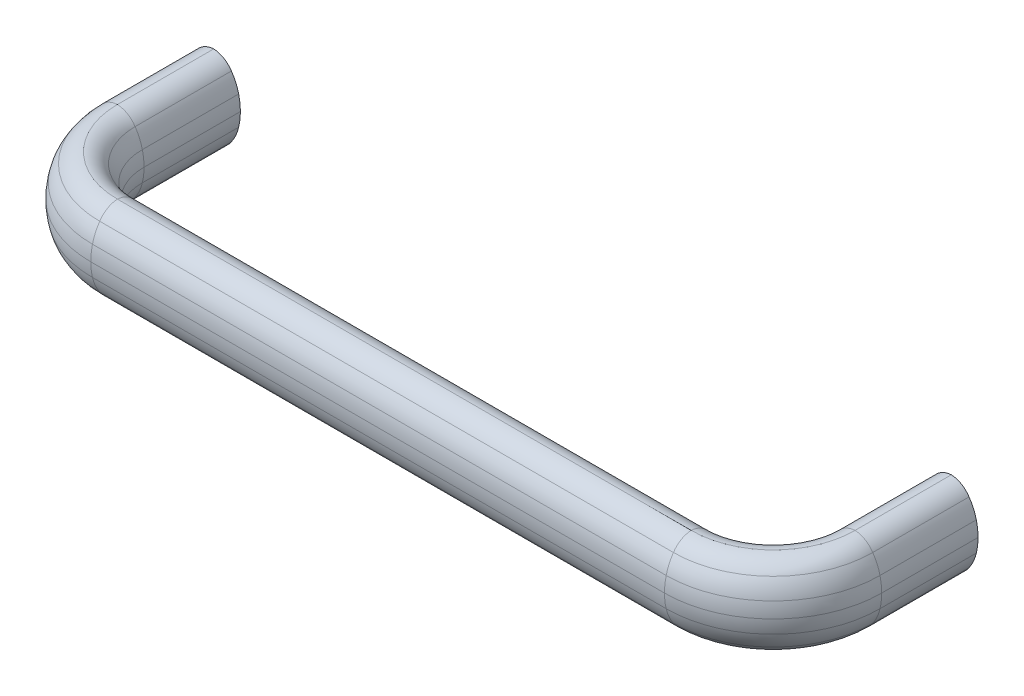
ISO-10303-21;
HEADER;
FILE_DESCRIPTION(('STEP AP214'),'2;1');
FILE_NAME('part.step','',(''),(''),'','','');
FILE_SCHEMA(('AUTOMOTIVE_DESIGN { 1 0 10303 214 1 1 1 1 }'));
ENDSEC;
DATA;
#1=APPLICATION_CONTEXT('core data for automotive mechanical design processes');
#2=APPLICATION_PROTOCOL_DEFINITION('international standard','automotive_design',2000,#1);
#3=PRODUCT_CONTEXT('',#1,'mechanical');
#4=PRODUCT('Part','Part','',(#3));
#5=PRODUCT_RELATED_PRODUCT_CATEGORY('part','',(#4));
#6=PRODUCT_DEFINITION_FORMATION('','',#4);
#7=PRODUCT_DEFINITION_CONTEXT('part definition',#1,'design');
#8=PRODUCT_DEFINITION('design','',#6,#7);
#9=PRODUCT_DEFINITION_SHAPE('','',#8);
#10=(LENGTH_UNIT() NAMED_UNIT(*) SI_UNIT(.MILLI.,.METRE.));
#11=(NAMED_UNIT(*) PLANE_ANGLE_UNIT() SI_UNIT($,.RADIAN.));
#12=(NAMED_UNIT(*) SI_UNIT($,.STERADIAN.) SOLID_ANGLE_UNIT());
#13=UNCERTAINTY_MEASURE_WITH_UNIT(LENGTH_MEASURE(1.E-05),#10,'distance_accuracy_value','');
#14=(GEOMETRIC_REPRESENTATION_CONTEXT(3) GLOBAL_UNCERTAINTY_ASSIGNED_CONTEXT((#13)) GLOBAL_UNIT_ASSIGNED_CONTEXT((#10,
#11,#12)) REPRESENTATION_CONTEXT('',''));
#15=CARTESIAN_POINT('',(0.,0.,0.));
#16=DIRECTION('',(0.,0.,1.));
#17=DIRECTION('',(1.,0.,0.));
#18=AXIS2_PLACEMENT_3D('',#15,#16,#17);
#19=CARTESIAN_POINT('',(171.596296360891,0.023316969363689,23.5));
#20=DIRECTION('',(0.,0.,-1.));
#21=DIRECTION('',(0.,-1.,0.));
#22=AXIS2_PLACEMENT_3D('',#19,#20,#21);
#23=CYLINDRICAL_SURFACE('',#22,14.9037218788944);
#24=DIRECTION('',(0.,0.,1.));
#25=VECTOR('',#24,1.);
#26=CARTESIAN_POINT('',(186.085583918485,3.5135135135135,0.));
#27=LINE('',#26,#25);
#28=CARTESIAN_POINT('',(186.085583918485,3.51351351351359,0.));
#29=VERTEX_POINT('',#28);
#30=CARTESIAN_POINT('',(186.085583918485,3.5135135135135,23.5));
#31=VERTEX_POINT('',#30);
#32=EDGE_CURVE('E515',#29,#31,#27,.T.);
#33=ORIENTED_EDGE('',*,*,#32,.T.);
#34=CARTESIAN_POINT('',(171.596296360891,0.0233169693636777,23.5));
#35=DIRECTION('',(0.,0.,1.));
#36=DIRECTION('',(0.999998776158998,-0.00156450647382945,0.));
#37=AXIS2_PLACEMENT_3D('',#34,#35,#36);
#38=CIRCLE('',#37,14.9037218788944);
#39=CARTESIAN_POINT('',(186.5,0.,23.5));
#40=VERTEX_POINT('',#39);
#41=EDGE_CURVE('E21',#40,#31,#38,.T.);
#42=ORIENTED_EDGE('',*,*,#41,.F.);
#43=DIRECTION('',(0.,0.,1.));
#44=VECTOR('',#43,1.);
#45=CARTESIAN_POINT('',(186.5,0.,0.));
#46=LINE('',#45,#44);
#47=CARTESIAN_POINT('',(186.5,0.,0.));
#48=VERTEX_POINT('',#47);
#49=EDGE_CURVE('E643',#48,#40,#46,.T.);
#50=ORIENTED_EDGE('',*,*,#49,.F.);
#51=CARTESIAN_POINT('',(171.596296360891,0.023316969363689,0.));
#52=DIRECTION('',(0.,0.,-1.));
#53=DIRECTION('',(0.972192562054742,0.234182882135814,0.));
#54=AXIS2_PLACEMENT_3D('',#51,#52,#53);
#55=CIRCLE('',#54,14.9037218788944);
#56=EDGE_CURVE('E524',#29,#48,#55,.T.);
#57=ORIENTED_EDGE('',*,*,#56,.F.);
#58=EDGE_LOOP('',(#33,#42,#50,#57));
#59=FACE_BOUND('',#58,.T.);
#60=ADVANCED_FACE('F14',(#59),#23,.T.);
#61=CARTESIAN_POINT('',(160.,0.0233169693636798,23.5));
#62=DIRECTION('',(0.,1.,0.));
#63=DIRECTION('',(1.,0.,0.));
#64=AXIS2_PLACEMENT_3D('',#61,#62,#63);
#65=DEGENERATE_TOROIDAL_SURFACE('',#64,11.5962963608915,14.9037218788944,.T.);
#66=CARTESIAN_POINT('',(160.,3.51351351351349,23.5));
#67=DIRECTION('',(0.,-1.,0.));
#68=DIRECTION('',(1.,0.,0.));
#69=AXIS2_PLACEMENT_3D('',#66,#67,#68);
#70=CIRCLE('',#69,26.0855839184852);
#71=CARTESIAN_POINT('',(160.,3.51351351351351,49.5855839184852));
#72=VERTEX_POINT('',#71);
#73=EDGE_CURVE('E505',#31,#72,#70,.T.);
#74=ORIENTED_EDGE('',*,*,#73,.T.);
#75=CARTESIAN_POINT('',(160.,0.0233169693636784,35.0962963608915));
#76=DIRECTION('',(1.,0.,0.));
#77=DIRECTION('',(0.,0.234182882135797,0.972192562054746));
#78=AXIS2_PLACEMENT_3D('',#75,#76,#77);
#79=CIRCLE('',#78,14.9037218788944);
#80=CARTESIAN_POINT('',(160.,0.,50.));
#81=VERTEX_POINT('',#80);
#82=EDGE_CURVE('E467',#72,#81,#79,.T.);
#83=ORIENTED_EDGE('',*,*,#82,.T.);
#84=CARTESIAN_POINT('',(160.,0.,23.5));
#85=DIRECTION('',(0.,-1.,0.));
#86=DIRECTION('',(1.,0.,0.));
#87=AXIS2_PLACEMENT_3D('',#84,#85,#86);
#88=CIRCLE('',#87,26.5);
#89=EDGE_CURVE('E646',#40,#81,#88,.T.);
#90=ORIENTED_EDGE('',*,*,#89,.F.);
#91=ORIENTED_EDGE('',*,*,#41,.T.);
#92=EDGE_LOOP('',(#74,#83,#90,#91));
#93=FACE_BOUND('',#92,.T.);
#94=ADVANCED_FACE('F663',(#93),#65,.T.);
#95=CARTESIAN_POINT('',(160.,-0.0233169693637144,23.5));
#96=DIRECTION('',(0.,1.,0.));
#97=DIRECTION('',(1.,0.,0.));
#98=AXIS2_PLACEMENT_3D('',#95,#96,#97);
#99=DEGENERATE_TOROIDAL_SURFACE('',#98,11.5962963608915,14.9037218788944,.T.);
#100=ORIENTED_EDGE('',*,*,#89,.T.);
#101=CARTESIAN_POINT('',(160.,-0.0233169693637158,35.0962963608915));
#102=DIRECTION('',(1.,0.,0.));
#103=DIRECTION('',(0.,0.00156450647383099,0.999998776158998));
#104=AXIS2_PLACEMENT_3D('',#101,#102,#103);
#105=CIRCLE('',#104,14.9037218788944);
#106=CARTESIAN_POINT('',(160.,-3.51351351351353,49.5855839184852));
#107=VERTEX_POINT('',#106);
#108=EDGE_CURVE('E471',#81,#107,#105,.T.);
#109=ORIENTED_EDGE('',*,*,#108,.T.);
#110=CARTESIAN_POINT('',(160.,-3.51351351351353,23.5));
#111=DIRECTION('',(0.,1.,0.));
#112=DIRECTION('',(0.,0.,1.));
#113=AXIS2_PLACEMENT_3D('',#110,#111,#112);
#114=CIRCLE('',#113,26.0855839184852);
#115=CARTESIAN_POINT('',(186.085583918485,-3.51351351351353,23.5));
#116=VERTEX_POINT('',#115);
#117=EDGE_CURVE('E637',#107,#116,#114,.T.);
#118=ORIENTED_EDGE('',*,*,#117,.T.);
#119=CARTESIAN_POINT('',(171.596296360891,-0.0233169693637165,23.5));
#120=DIRECTION('',(0.,0.,1.));
#121=DIRECTION('',(0.972192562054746,-0.234182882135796,0.));
#122=AXIS2_PLACEMENT_3D('',#119,#120,#121);
#123=CIRCLE('',#122,14.9037218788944);
#124=EDGE_CURVE('E642',#116,#40,#123,.T.);
#125=ORIENTED_EDGE('',*,*,#124,.T.);
#126=EDGE_LOOP('',(#100,#109,#118,#125));
#127=FACE_BOUND('',#126,.T.);
#128=ADVANCED_FACE('F680',(#127),#99,.T.);
#129=CARTESIAN_POINT('',(171.596296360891,-0.0233169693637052,23.5));
#130=DIRECTION('',(0.,0.,-1.));
#131=DIRECTION('',(0.,-1.,0.));
#132=AXIS2_PLACEMENT_3D('',#129,#130,#131);
#133=CYLINDRICAL_SURFACE('',#132,14.9037218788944);
#134=ORIENTED_EDGE('',*,*,#49,.T.);
#135=ORIENTED_EDGE('',*,*,#124,.F.);
#136=DIRECTION('',(0.,0.,1.));
#137=VECTOR('',#136,1.);
#138=CARTESIAN_POINT('',(186.085583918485,-3.51351351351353,0.));
#139=LINE('',#138,#137);
#140=CARTESIAN_POINT('',(186.085583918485,-3.51351351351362,0.));
#141=VERTEX_POINT('',#140);
#142=EDGE_CURVE('E639',#141,#116,#139,.T.);
#143=ORIENTED_EDGE('',*,*,#142,.F.);
#144=CARTESIAN_POINT('',(171.596296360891,-0.0233169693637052,0.));
#145=DIRECTION('',(0.,0.,-1.));
#146=DIRECTION('',(0.999998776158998,0.00156450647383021,0.));
#147=AXIS2_PLACEMENT_3D('',#144,#145,#146);
#148=CIRCLE('',#147,14.9037218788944);
#149=EDGE_CURVE('E521',#48,#141,#148,.T.);
#150=ORIENTED_EDGE('',*,*,#149,.F.);
#151=EDGE_LOOP('',(#134,#135,#143,#150));
#152=FACE_BOUND('',#151,.T.);
#153=ADVANCED_FACE('F748',(#152),#133,.T.);
#154=CARTESIAN_POINT('',(175.044200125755,-0.961217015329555,23.5));
#155=DIRECTION('',(0.,0.,-1.));
#156=DIRECTION('',(0.,-1.,0.));
#157=AXIS2_PLACEMENT_3D('',#154,#155,#156);
#158=CYLINDRICAL_SURFACE('',#157,11.3325360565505);
#159=ORIENTED_EDGE('',*,*,#142,.T.);
#160=CARTESIAN_POINT('',(175.044200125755,-0.961217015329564,23.5));
#161=DIRECTION('',(0.,0.,1.));
#162=DIRECTION('',(0.818208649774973,-0.574921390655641,0.));
#163=AXIS2_PLACEMENT_3D('',#160,#161,#162);
#164=CIRCLE('',#163,11.3325360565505);
#165=CARTESIAN_POINT('',(184.316579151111,-7.47653440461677,23.5));
#166=VERTEX_POINT('',#165);
#167=EDGE_CURVE('E634',#166,#116,#164,.T.);
#168=ORIENTED_EDGE('',*,*,#167,.F.);
#169=DIRECTION('',(0.,0.,1.));
#170=VECTOR('',#169,1.);
#171=CARTESIAN_POINT('',(184.316579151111,-7.47653440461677,0.));
#172=LINE('',#171,#170);
#173=CARTESIAN_POINT('',(184.316579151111,-7.47653440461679,0.));
#174=VERTEX_POINT('',#173);
#175=EDGE_CURVE('E557',#174,#166,#172,.T.);
#176=ORIENTED_EDGE('',*,*,#175,.F.);
#177=CARTESIAN_POINT('',(175.044200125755,-0.961217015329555,0.));
#178=DIRECTION('',(0.,0.,-1.));
#179=DIRECTION('',(0.974308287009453,-0.225218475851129,0.));
#180=AXIS2_PLACEMENT_3D('',#177,#178,#179);
#181=CIRCLE('',#180,11.3325360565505);
#182=EDGE_CURVE('E518',#141,#174,#181,.T.);
#183=ORIENTED_EDGE('',*,*,#182,.F.);
#184=EDGE_LOOP('',(#159,#168,#176,#183));
#185=FACE_BOUND('',#184,.T.);
#186=ADVANCED_FACE('F745',(#185),#158,.T.);
#187=CARTESIAN_POINT('',(160.,-0.961217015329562,23.5));
#188=DIRECTION('',(0.,1.,0.));
#189=DIRECTION('',(1.,0.,0.));
#190=AXIS2_PLACEMENT_3D('',#187,#188,#189);
#191=TOROIDAL_SURFACE('',#190,15.0442001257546,11.3325360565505);
#192=ORIENTED_EDGE('',*,*,#117,.F.);
#193=CARTESIAN_POINT('',(160.,-0.961217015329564,38.5442001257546));
#194=DIRECTION('',(1.,0.,0.));
#195=DIRECTION('',(0.,-0.225218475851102,0.974308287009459));
#196=AXIS2_PLACEMENT_3D('',#193,#194,#195);
#197=CIRCLE('',#196,11.3325360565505);
#198=CARTESIAN_POINT('',(160.,-7.47653440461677,47.816579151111));
#199=VERTEX_POINT('',#198);
#200=EDGE_CURVE('E474',#107,#199,#197,.T.);
#201=ORIENTED_EDGE('',*,*,#200,.T.);
#202=CARTESIAN_POINT('',(160.,-7.47653440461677,23.5));
#203=DIRECTION('',(0.,-1.,0.));
#204=DIRECTION('',(1.,0.,0.));
#205=AXIS2_PLACEMENT_3D('',#202,#203,#204);
#206=CIRCLE('',#205,24.316579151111);
#207=EDGE_CURVE('E628',#166,#199,#206,.T.);
#208=ORIENTED_EDGE('',*,*,#207,.F.);
#209=ORIENTED_EDGE('',*,*,#167,.T.);
#210=EDGE_LOOP('',(#192,#201,#208,#209));
#211=FACE_BOUND('',#210,.T.);
#212=ADVANCED_FACE('F694',(#211),#191,.T.);
#213=CARTESIAN_POINT('',(160.,-4.49051001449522,23.5));
#214=DIRECTION('',(0.,1.,0.));
#215=DIRECTION('',(1.,0.,0.));
#216=AXIS2_PLACEMENT_3D('',#213,#214,#215);
#217=TOROIDAL_SURFACE('',#216,19.6750571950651,5.51906402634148);
#218=ORIENTED_EDGE('',*,*,#207,.T.);
#219=CARTESIAN_POINT('',(160.,-4.49051001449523,43.1750571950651));
#220=DIRECTION('',(1.,0.,0.));
#221=DIRECTION('',(0.,-0.541038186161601,0.8409980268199));
#222=AXIS2_PLACEMENT_3D('',#219,#220,#221);
#223=CIRCLE('',#222,5.51906402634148);
#224=CARTESIAN_POINT('',(160.,-10.,43.5));
#225=VERTEX_POINT('',#224);
#226=EDGE_CURVE('E477',#199,#225,#223,.T.);
#227=ORIENTED_EDGE('',*,*,#226,.T.);
#228=CARTESIAN_POINT('',(160.,-10.,23.5));
#229=DIRECTION('',(0.,-1.,0.));
#230=DIRECTION('',(1.,0.,0.));
#231=AXIS2_PLACEMENT_3D('',#228,#229,#230);
#232=CIRCLE('',#231,20.);
#233=CARTESIAN_POINT('',(180.,-10.,23.5));
#234=VERTEX_POINT('',#233);
#235=EDGE_CURVE('E622',#234,#225,#232,.T.);
#236=ORIENTED_EDGE('',*,*,#235,.F.);
#237=CARTESIAN_POINT('',(179.675057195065,-4.49051001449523,23.5));
#238=DIRECTION('',(0.,0.,1.));
#239=DIRECTION('',(0.0588764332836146,-0.99826527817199,0.));
#240=AXIS2_PLACEMENT_3D('',#237,#238,#239);
#241=CIRCLE('',#240,5.51906402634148);
#242=EDGE_CURVE('E556',#234,#166,#241,.T.);
#243=ORIENTED_EDGE('',*,*,#242,.T.);
#244=EDGE_LOOP('',(#218,#227,#236,#243));
#245=FACE_BOUND('',#244,.T.);
#246=ADVANCED_FACE('F697',(#245),#217,.T.);
#247=CARTESIAN_POINT('',(160.,-4.49051001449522,23.5));
#248=DIRECTION('',(0.,1.,0.));
#249=DIRECTION('',(1.,0.,0.));
#250=AXIS2_PLACEMENT_3D('',#247,#248,#249);
#251=TOROIDAL_SURFACE('',#250,20.3249428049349,5.51906402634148);
#252=ORIENTED_EDGE('',*,*,#235,.T.);
#253=CARTESIAN_POINT('',(160.,-4.49051001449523,43.8249428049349));
#254=DIRECTION('',(1.,0.,0.));
#255=DIRECTION('',(0.,-0.99826527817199,-0.0588764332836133));
#256=AXIS2_PLACEMENT_3D('',#253,#254,#255);
#257=CIRCLE('',#256,5.51906402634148);
#258=CARTESIAN_POINT('',(160.,-7.47653440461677,39.183420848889));
#259=VERTEX_POINT('',#258);
#260=EDGE_CURVE('E480',#225,#259,#257,.T.);
#261=ORIENTED_EDGE('',*,*,#260,.T.);
#262=CARTESIAN_POINT('',(160.,-7.47653440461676,23.5));
#263=DIRECTION('',(0.,-1.,0.));
#264=DIRECTION('',(1.,0.,0.));
#265=AXIS2_PLACEMENT_3D('',#262,#263,#264);
#266=CIRCLE('',#265,15.683420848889);
#267=CARTESIAN_POINT('',(175.683420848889,-7.47653440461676,23.5));
#268=VERTEX_POINT('',#267);
#269=EDGE_CURVE('E614',#268,#259,#266,.T.);
#270=ORIENTED_EDGE('',*,*,#269,.F.);
#271=CARTESIAN_POINT('',(180.324942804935,-4.49051001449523,23.5));
#272=DIRECTION('',(0.,0.,1.));
#273=DIRECTION('',(-0.840998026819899,-0.541038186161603,0.));
#274=AXIS2_PLACEMENT_3D('',#271,#272,#273);
#275=CIRCLE('',#274,5.51906402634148);
#276=EDGE_CURVE('E563',#268,#234,#275,.T.);
#277=ORIENTED_EDGE('',*,*,#276,.T.);
#278=EDGE_LOOP('',(#252,#261,#270,#277));
#279=FACE_BOUND('',#278,.T.);
#280=ADVANCED_FACE('F710',(#279),#251,.T.);
#281=CARTESIAN_POINT('',(160.,-0.961217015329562,23.5));
#282=DIRECTION('',(0.,1.,0.));
#283=DIRECTION('',(1.,0.,0.));
#284=AXIS2_PLACEMENT_3D('',#281,#282,#283);
#285=TOROIDAL_SURFACE('',#284,24.9557998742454,11.3325360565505);
#286=ORIENTED_EDGE('',*,*,#269,.T.);
#287=CARTESIAN_POINT('',(160.,-0.961217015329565,48.4557998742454));
#288=DIRECTION('',(1.,0.,0.));
#289=DIRECTION('',(0.,-0.57492139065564,-0.818208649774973));
#290=AXIS2_PLACEMENT_3D('',#287,#288,#289);
#291=CIRCLE('',#290,11.3325360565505);
#292=CARTESIAN_POINT('',(160.,-3.51351351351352,37.4144160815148));
#293=VERTEX_POINT('',#292);
#294=EDGE_CURVE('E483',#259,#293,#291,.T.);
#295=ORIENTED_EDGE('',*,*,#294,.T.);
#296=CARTESIAN_POINT('',(160.,-3.51351351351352,23.5));
#297=DIRECTION('',(0.,-1.,0.));
#298=DIRECTION('',(1.,0.,0.));
#299=AXIS2_PLACEMENT_3D('',#296,#297,#298);
#300=CIRCLE('',#299,13.9144160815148);
#301=CARTESIAN_POINT('',(173.914416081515,-3.51351351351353,23.5));
#302=VERTEX_POINT('',#301);
#303=EDGE_CURVE('E606',#302,#293,#300,.T.);
#304=ORIENTED_EDGE('',*,*,#303,.F.);
#305=CARTESIAN_POINT('',(184.955799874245,-0.961217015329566,23.5));
#306=DIRECTION('',(0.,0.,1.));
#307=DIRECTION('',(-0.974308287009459,-0.225218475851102,0.));
#308=AXIS2_PLACEMENT_3D('',#305,#306,#307);
#309=CIRCLE('',#308,11.3325360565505);
#310=EDGE_CURVE('E567',#302,#268,#309,.T.);
#311=ORIENTED_EDGE('',*,*,#310,.T.);
#312=EDGE_LOOP('',(#286,#295,#304,#311));
#313=FACE_BOUND('',#312,.T.);
#314=ADVANCED_FACE('F713',(#313),#285,.T.);
#315=CARTESIAN_POINT('',(160.,-0.0233169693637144,23.5));
#316=DIRECTION('',(0.,1.,0.));
#317=DIRECTION('',(1.,0.,0.));
#318=AXIS2_PLACEMENT_3D('',#315,#316,#317);
#319=TOROIDAL_SURFACE('',#318,28.4037036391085,14.9037218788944);
#320=CARTESIAN_POINT('',(188.403703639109,-0.0233169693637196,23.5));
#321=DIRECTION('',(0.,0.,1.));
#322=DIRECTION('',(-1.,0.,0.));
#323=AXIS2_PLACEMENT_3D('',#320,#321,#322);
#324=CIRCLE('',#323,14.9037218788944);
#325=CARTESIAN_POINT('',(173.499981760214,-0.0233169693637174,23.5));
#326=VERTEX_POINT('',#325);
#327=EDGE_CURVE('E576',#326,#302,#324,.T.);
#328=ORIENTED_EDGE('',*,*,#327,.T.);
#329=ORIENTED_EDGE('',*,*,#303,.T.);
#330=CARTESIAN_POINT('',(160.,-0.0233169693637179,51.9037036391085));
#331=DIRECTION('',(1.,0.,0.));
#332=DIRECTION('',(0.,-0.234182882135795,-0.972192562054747));
#333=AXIS2_PLACEMENT_3D('',#330,#331,#332);
#334=CIRCLE('',#333,14.9037218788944);
#335=CARTESIAN_POINT('',(160.,-0.0233169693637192,36.9999817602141));
#336=VERTEX_POINT('',#335);
#337=EDGE_CURVE('E486',#293,#336,#334,.T.);
#338=ORIENTED_EDGE('',*,*,#337,.T.);
#339=DIRECTION('',(0.,0.999999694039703,0.000782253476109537));
#340=VECTOR('',#339,1.);
#341=CARTESIAN_POINT('',(160.,-0.0233169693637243,36.9999817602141));
#342=LINE('',#341,#340);
#343=CARTESIAN_POINT('',(160.,0.,37.));
#344=VERTEX_POINT('',#343);
#345=EDGE_CURVE('E490',#336,#344,#342,.T.);
#346=ORIENTED_EDGE('',*,*,#345,.T.);
#347=CARTESIAN_POINT('',(160.,0.,23.5));
#348=DIRECTION('',(0.,-1.,0.));
#349=DIRECTION('',(1.,0.,0.));
#350=AXIS2_PLACEMENT_3D('',#347,#348,#349);
#351=CIRCLE('',#350,13.5);
#352=CARTESIAN_POINT('',(173.5,0.,23.5));
#353=VERTEX_POINT('',#352);
#354=EDGE_CURVE('E600',#353,#344,#351,.T.);
#355=ORIENTED_EDGE('',*,*,#354,.F.);
#356=DIRECTION('',(-0.000782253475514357,-0.999999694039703,0.));
#357=VECTOR('',#356,1.);
#358=CARTESIAN_POINT('',(173.5,0.,23.5));
#359=LINE('',#358,#357);
#360=EDGE_CURVE('E571',#353,#326,#359,.T.);
#361=ORIENTED_EDGE('',*,*,#360,.T.);
#362=EDGE_LOOP('',(#328,#329,#338,#346,#355,#361));
#363=FACE_BOUND('',#362,.T.);
#364=ADVANCED_FACE('F726',(#363),#319,.T.);
#365=CARTESIAN_POINT('',(160.,0.0233169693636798,23.5));
#366=DIRECTION('',(0.,1.,0.));
#367=DIRECTION('',(1.,0.,0.));
#368=AXIS2_PLACEMENT_3D('',#365,#366,#367);
#369=TOROIDAL_SURFACE('',#368,28.4037036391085,14.9037218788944);
#370=DIRECTION('',(0.000782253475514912,-0.999999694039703,0.));
#371=VECTOR('',#370,1.);
#372=CARTESIAN_POINT('',(173.499981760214,0.0233169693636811,23.5));
#373=LINE('',#372,#371);
#374=CARTESIAN_POINT('',(173.499981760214,0.0233169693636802,23.5));
#375=VERTEX_POINT('',#374);
#376=EDGE_CURVE('E581',#375,#353,#373,.T.);
#377=ORIENTED_EDGE('',*,*,#376,.T.);
#378=ORIENTED_EDGE('',*,*,#354,.T.);
#379=DIRECTION('',(0.,0.999999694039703,-0.000782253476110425));
#380=VECTOR('',#379,1.);
#381=CARTESIAN_POINT('',(160.,0.,37.));
#382=LINE('',#381,#380);
#383=CARTESIAN_POINT('',(160.,0.023316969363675,36.9999817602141));
#384=VERTEX_POINT('',#383);
#385=EDGE_CURVE('E489',#344,#384,#382,.T.);
#386=ORIENTED_EDGE('',*,*,#385,.T.);
#387=CARTESIAN_POINT('',(160.,0.0233169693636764,51.9037036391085));
#388=DIRECTION('',(1.,0.,0.));
#389=DIRECTION('',(0.,0.,-1.));
#390=AXIS2_PLACEMENT_3D('',#387,#388,#389);
#391=CIRCLE('',#390,14.9037218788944);
#392=CARTESIAN_POINT('',(160.,3.51351351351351,37.4144160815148));
#393=VERTEX_POINT('',#392);
#394=EDGE_CURVE('E498',#384,#393,#391,.T.);
#395=ORIENTED_EDGE('',*,*,#394,.T.);
#396=CARTESIAN_POINT('',(160.,3.5135135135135,23.5));
#397=DIRECTION('',(0.,-1.,0.));
#398=DIRECTION('',(1.,0.,0.));
#399=AXIS2_PLACEMENT_3D('',#396,#397,#398);
#400=CIRCLE('',#399,13.9144160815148);
#401=CARTESIAN_POINT('',(173.914416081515,3.5135135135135,23.5));
#402=VERTEX_POINT('',#401);
#403=EDGE_CURVE('E596',#402,#393,#400,.T.);
#404=ORIENTED_EDGE('',*,*,#403,.F.);
#405=CARTESIAN_POINT('',(188.403703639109,0.0233169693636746,23.5));
#406=DIRECTION('',(0.,0.,1.));
#407=DIRECTION('',(-0.972192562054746,0.234182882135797,0.));
#408=AXIS2_PLACEMENT_3D('',#405,#406,#407);
#409=CIRCLE('',#408,14.9037218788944);
#410=EDGE_CURVE('E575',#402,#375,#409,.T.);
#411=ORIENTED_EDGE('',*,*,#410,.T.);
#412=EDGE_LOOP('',(#377,#378,#386,#395,#404,#411));
#413=FACE_BOUND('',#412,.T.);
#414=ADVANCED_FACE('F823',(#413),#369,.T.);
#415=CARTESIAN_POINT('',(160.,0.961217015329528,23.5));
#416=DIRECTION('',(0.,1.,0.));
#417=DIRECTION('',(1.,0.,0.));
#418=AXIS2_PLACEMENT_3D('',#415,#416,#417);
#419=TOROIDAL_SURFACE('',#418,24.9557998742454,11.3325360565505);
#420=ORIENTED_EDGE('',*,*,#403,.T.);
#421=CARTESIAN_POINT('',(160.,0.961217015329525,48.4557998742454));
#422=DIRECTION('',(1.,0.,0.));
#423=DIRECTION('',(0.,0.225218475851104,-0.974308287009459));
#424=AXIS2_PLACEMENT_3D('',#421,#422,#423);
#425=CIRCLE('',#424,11.3325360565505);
#426=CARTESIAN_POINT('',(160.,7.47653440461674,39.183420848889));
#427=VERTEX_POINT('',#426);
#428=EDGE_CURVE('E495',#393,#427,#425,.T.);
#429=ORIENTED_EDGE('',*,*,#428,.T.);
#430=CARTESIAN_POINT('',(160.,7.47653440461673,23.5));
#431=DIRECTION('',(0.,1.,0.));
#432=DIRECTION('',(0.,0.,1.));
#433=AXIS2_PLACEMENT_3D('',#430,#431,#432);
#434=CIRCLE('',#433,15.683420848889);
#435=CARTESIAN_POINT('',(175.683420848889,7.47653440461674,23.5));
#436=VERTEX_POINT('',#435);
#437=EDGE_CURVE('E590',#427,#436,#434,.T.);
#438=ORIENTED_EDGE('',*,*,#437,.T.);
#439=CARTESIAN_POINT('',(184.955799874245,0.961217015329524,23.5));
#440=DIRECTION('',(0.,0.,1.));
#441=DIRECTION('',(-0.818208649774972,0.574921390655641,0.));
#442=AXIS2_PLACEMENT_3D('',#439,#440,#441);
#443=CIRCLE('',#442,11.3325360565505);
#444=EDGE_CURVE('E580',#436,#402,#443,.T.);
#445=ORIENTED_EDGE('',*,*,#444,.T.);
#446=EDGE_LOOP('',(#420,#429,#438,#445));
#447=FACE_BOUND('',#446,.T.);
#448=ADVANCED_FACE('F798',(#447),#419,.T.);
#449=CARTESIAN_POINT('',(160.,4.49051001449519,23.5));
#450=DIRECTION('',(0.,1.,0.));
#451=DIRECTION('',(1.,0.,0.));
#452=AXIS2_PLACEMENT_3D('',#449,#450,#451);
#453=TOROIDAL_SURFACE('',#452,20.3249428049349,5.51906402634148);
#454=ORIENTED_EDGE('',*,*,#437,.F.);
#455=CARTESIAN_POINT('',(160.,4.49051001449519,43.8249428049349));
#456=DIRECTION('',(1.,0.,0.));
#457=DIRECTION('',(0.,0.541038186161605,-0.840998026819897));
#458=AXIS2_PLACEMENT_3D('',#455,#456,#457);
#459=CIRCLE('',#458,5.51906402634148);
#460=CARTESIAN_POINT('',(160.,10.,43.5));
#461=VERTEX_POINT('',#460);
#462=EDGE_CURVE('E494',#427,#461,#459,.T.);
#463=ORIENTED_EDGE('',*,*,#462,.T.);
#464=CARTESIAN_POINT('',(160.,10.,23.5));
#465=DIRECTION('',(0.,-1.,0.));
#466=DIRECTION('',(1.,0.,0.));
#467=AXIS2_PLACEMENT_3D('',#464,#465,#466);
#468=CIRCLE('',#467,20.);
#469=CARTESIAN_POINT('',(180.,10.,23.5));
#470=VERTEX_POINT('',#469);
#471=EDGE_CURVE('E36',#470,#461,#468,.T.);
#472=ORIENTED_EDGE('',*,*,#471,.F.);
#473=CARTESIAN_POINT('',(180.324942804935,4.49051001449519,23.5));
#474=DIRECTION('',(0.,0.,1.));
#475=DIRECTION('',(-0.0588764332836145,0.99826527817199,0.));
#476=AXIS2_PLACEMENT_3D('',#473,#474,#475);
#477=CIRCLE('',#476,5.51906402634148);
#478=EDGE_CURVE('E585',#470,#436,#477,.T.);
#479=ORIENTED_EDGE('',*,*,#478,.T.);
#480=EDGE_LOOP('',(#454,#463,#472,#479));
#481=FACE_BOUND('',#480,.T.);
#482=ADVANCED_FACE('F760',(#481),#453,.T.);
#483=CARTESIAN_POINT('',(160.,4.49051001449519,23.5));
#484=DIRECTION('',(0.,1.,0.));
#485=DIRECTION('',(1.,0.,0.));
#486=AXIS2_PLACEMENT_3D('',#483,#484,#485);
#487=TOROIDAL_SURFACE('',#486,19.6750571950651,5.51906402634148);
#488=ORIENTED_EDGE('',*,*,#471,.T.);
#489=CARTESIAN_POINT('',(160.,4.49051001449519,43.1750571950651));
#490=DIRECTION('',(1.,0.,0.));
#491=DIRECTION('',(0.,0.99826527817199,0.0588764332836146));
#492=AXIS2_PLACEMENT_3D('',#489,#490,#491);
#493=CIRCLE('',#492,5.51906402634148);
#494=CARTESIAN_POINT('',(160.,7.47653440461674,47.816579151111));
#495=VERTEX_POINT('',#494);
#496=EDGE_CURVE('E501',#461,#495,#493,.T.);
#497=ORIENTED_EDGE('',*,*,#496,.T.);
#498=CARTESIAN_POINT('',(160.,7.47653440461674,23.5));
#499=DIRECTION('',(0.,-1.,0.));
#500=DIRECTION('',(1.,0.,0.));
#501=AXIS2_PLACEMENT_3D('',#498,#499,#500);
#502=CIRCLE('',#501,24.316579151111);
#503=CARTESIAN_POINT('',(184.316579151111,7.47653440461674,23.5));
#504=VERTEX_POINT('',#503);
#505=EDGE_CURVE('E28',#504,#495,#502,.T.);
#506=ORIENTED_EDGE('',*,*,#505,.F.);
#507=CARTESIAN_POINT('',(179.675057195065,4.49051001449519,23.5));
#508=DIRECTION('',(0.,0.,1.));
#509=DIRECTION('',(0.840998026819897,0.541038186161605,0.));
#510=AXIS2_PLACEMENT_3D('',#507,#508,#509);
#511=CIRCLE('',#510,5.51906402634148);
#512=EDGE_CURVE('E586',#504,#470,#511,.T.);
#513=ORIENTED_EDGE('',*,*,#512,.T.);
#514=EDGE_LOOP('',(#488,#497,#506,#513));
#515=FACE_BOUND('',#514,.T.);
#516=ADVANCED_FACE('F789',(#515),#487,.T.);
#517=CARTESIAN_POINT('',(179.675057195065,4.4905100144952,23.5));
#518=DIRECTION('',(0.,0.,-1.));
#519=DIRECTION('',(0.,-1.,0.));
#520=AXIS2_PLACEMENT_3D('',#517,#518,#519);
#521=CYLINDRICAL_SURFACE('',#520,5.51906402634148);
#522=DIRECTION('',(0.,0.,1.));
#523=VECTOR('',#522,1.);
#524=CARTESIAN_POINT('',(180.,10.,0.));
#525=LINE('',#524,#523);
#526=CARTESIAN_POINT('',(180.,10.,0.));
#527=VERTEX_POINT('',#526);
#528=EDGE_CURVE('E582',#527,#470,#525,.T.);
#529=ORIENTED_EDGE('',*,*,#528,.T.);
#530=ORIENTED_EDGE('',*,*,#512,.F.);
#531=DIRECTION('',(0.,0.,1.));
#532=VECTOR('',#531,1.);
#533=CARTESIAN_POINT('',(184.316579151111,7.47653440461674,0.));
#534=LINE('',#533,#532);
#535=CARTESIAN_POINT('',(184.316579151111,7.47653440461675,0.));
#536=VERTEX_POINT('',#535);
#537=EDGE_CURVE('E511',#536,#504,#534,.T.);
#538=ORIENTED_EDGE('',*,*,#537,.F.);
#539=CARTESIAN_POINT('',(179.675057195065,4.4905100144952,0.));
#540=DIRECTION('',(0.,0.,-1.));
#541=DIRECTION('',(0.0588764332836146,0.99826527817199,0.));
#542=AXIS2_PLACEMENT_3D('',#539,#540,#541);
#543=CIRCLE('',#542,5.51906402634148);
#544=EDGE_CURVE('E527',#527,#536,#543,.T.);
#545=ORIENTED_EDGE('',*,*,#544,.F.);
#546=EDGE_LOOP('',(#529,#530,#538,#545));
#547=FACE_BOUND('',#546,.T.);
#548=ADVANCED_FACE('F753',(#547),#521,.T.);
#549=CARTESIAN_POINT('',(180.324942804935,4.4905100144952,23.5));
#550=DIRECTION('',(0.,0.,-1.));
#551=DIRECTION('',(0.,-1.,0.));
#552=AXIS2_PLACEMENT_3D('',#549,#550,#551);
#553=CYLINDRICAL_SURFACE('',#552,5.51906402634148);
#554=DIRECTION('',(0.,0.,1.));
#555=VECTOR('',#554,1.);
#556=CARTESIAN_POINT('',(175.683420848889,7.47653440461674,0.));
#557=LINE('',#556,#555);
#558=CARTESIAN_POINT('',(175.683420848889,7.47653440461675,0.));
#559=VERTEX_POINT('',#558);
#560=EDGE_CURVE('E577',#559,#436,#557,.T.);
#561=ORIENTED_EDGE('',*,*,#560,.T.);
#562=ORIENTED_EDGE('',*,*,#478,.F.);
#563=ORIENTED_EDGE('',*,*,#528,.F.);
#564=CARTESIAN_POINT('',(180.324942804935,4.4905100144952,0.));
#565=DIRECTION('',(0.,0.,-1.));
#566=DIRECTION('',(-0.840998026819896,0.541038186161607,0.));
#567=AXIS2_PLACEMENT_3D('',#564,#565,#566);
#568=CIRCLE('',#567,5.51906402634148);
#569=EDGE_CURVE('E532',#559,#527,#568,.T.);
#570=ORIENTED_EDGE('',*,*,#569,.F.);
#571=EDGE_LOOP('',(#561,#562,#563,#570));
#572=FACE_BOUND('',#571,.T.);
#573=ADVANCED_FACE('F756',(#572),#553,.T.);
#574=CARTESIAN_POINT('',(184.955799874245,0.961217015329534,23.5));
#575=DIRECTION('',(0.,0.,-1.));
#576=DIRECTION('',(0.,-1.,0.));
#577=AXIS2_PLACEMENT_3D('',#574,#575,#576);
#578=CYLINDRICAL_SURFACE('',#577,11.3325360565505);
#579=DIRECTION('',(0.,0.,1.));
#580=VECTOR('',#579,1.);
#581=CARTESIAN_POINT('',(173.914416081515,3.5135135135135,0.));
#582=LINE('',#581,#580);
#583=CARTESIAN_POINT('',(173.914416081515,3.51351351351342,0.));
#584=VERTEX_POINT('',#583);
#585=EDGE_CURVE('E572',#584,#402,#582,.T.);
#586=ORIENTED_EDGE('',*,*,#585,.T.);
#587=ORIENTED_EDGE('',*,*,#444,.F.);
#588=ORIENTED_EDGE('',*,*,#560,.F.);
#589=CARTESIAN_POINT('',(184.955799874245,0.961217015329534,0.));
#590=DIRECTION('',(0.,0.,-1.));
#591=DIRECTION('',(-0.974308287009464,0.22521847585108,0.));
#592=AXIS2_PLACEMENT_3D('',#589,#590,#591);
#593=CIRCLE('',#592,11.3325360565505);
#594=EDGE_CURVE('E535',#584,#559,#593,.T.);
#595=ORIENTED_EDGE('',*,*,#594,.F.);
#596=EDGE_LOOP('',(#586,#587,#588,#595));
#597=FACE_BOUND('',#596,.T.);
#598=ADVANCED_FACE('F976',(#597),#578,.T.);
#599=CARTESIAN_POINT('',(188.403703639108,0.0233169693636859,23.5));
#600=DIRECTION('',(0.,0.,-1.));
#601=DIRECTION('',(0.,-1.,0.));
#602=AXIS2_PLACEMENT_3D('',#599,#600,#601);
#603=CYLINDRICAL_SURFACE('',#602,14.9037218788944);
#604=DIRECTION('',(0.,0.,1.));
#605=VECTOR('',#604,1.);
#606=CARTESIAN_POINT('',(173.5,0.,0.));
#607=LINE('',#606,#605);
#608=CARTESIAN_POINT('',(173.5,0.,0.));
#609=VERTEX_POINT('',#608);
#610=EDGE_CURVE('E568',#609,#353,#607,.T.);
#611=ORIENTED_EDGE('',*,*,#610,.T.);
#612=ORIENTED_EDGE('',*,*,#376,.F.);
#613=ORIENTED_EDGE('',*,*,#410,.F.);
#614=ORIENTED_EDGE('',*,*,#585,.F.);
#615=CARTESIAN_POINT('',(188.403703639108,0.0233169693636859,0.));
#616=DIRECTION('',(0.,0.,-1.));
#617=DIRECTION('',(-0.999998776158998,-0.00156450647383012,0.));
#618=AXIS2_PLACEMENT_3D('',#615,#616,#617);
#619=CIRCLE('',#618,14.9037218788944);
#620=EDGE_CURVE('E538',#609,#584,#619,.T.);
#621=ORIENTED_EDGE('',*,*,#620,.F.);
#622=EDGE_LOOP('',(#611,#612,#613,#614,#621));
#623=FACE_BOUND('',#622,.T.);
#624=ADVANCED_FACE('F973',(#623),#603,.T.);
#625=CARTESIAN_POINT('',(188.403703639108,-0.0233169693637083,23.5));
#626=DIRECTION('',(0.,0.,-1.));
#627=DIRECTION('',(0.,-1.,0.));
#628=AXIS2_PLACEMENT_3D('',#625,#626,#627);
#629=CYLINDRICAL_SURFACE('',#628,14.9037218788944);
#630=DIRECTION('',(0.,0.,1.));
#631=VECTOR('',#630,1.);
#632=CARTESIAN_POINT('',(173.914416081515,-3.51351351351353,0.));
#633=LINE('',#632,#631);
#634=CARTESIAN_POINT('',(173.914416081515,-3.51351351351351,0.));
#635=VERTEX_POINT('',#634);
#636=EDGE_CURVE('E564',#635,#302,#633,.T.);
#637=ORIENTED_EDGE('',*,*,#636,.T.);
#638=ORIENTED_EDGE('',*,*,#327,.F.);
#639=ORIENTED_EDGE('',*,*,#360,.F.);
#640=ORIENTED_EDGE('',*,*,#610,.F.);
#641=CARTESIAN_POINT('',(188.403703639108,-0.0233169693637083,0.));
#642=DIRECTION('',(0.,0.,-1.));
#643=DIRECTION('',(-0.972192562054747,-0.234182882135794,0.));
#644=AXIS2_PLACEMENT_3D('',#641,#642,#643);
#645=CIRCLE('',#644,14.9037218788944);
#646=EDGE_CURVE('E541',#635,#609,#645,.T.);
#647=ORIENTED_EDGE('',*,*,#646,.F.);
#648=EDGE_LOOP('',(#637,#638,#639,#640,#647));
#649=FACE_BOUND('',#648,.T.);
#650=ADVANCED_FACE('F731',(#649),#629,.T.);
#651=CARTESIAN_POINT('',(184.955799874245,-0.961217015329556,23.5));
#652=DIRECTION('',(0.,0.,-1.));
#653=DIRECTION('',(0.,-1.,0.));
#654=AXIS2_PLACEMENT_3D('',#651,#652,#653);
#655=CYLINDRICAL_SURFACE('',#654,11.3325360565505);
#656=DIRECTION('',(0.,0.,1.));
#657=VECTOR('',#656,1.);
#658=CARTESIAN_POINT('',(175.683420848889,-7.47653440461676,0.));
#659=LINE('',#658,#657);
#660=CARTESIAN_POINT('',(175.683420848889,-7.47653440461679,0.));
#661=VERTEX_POINT('',#660);
#662=EDGE_CURVE('E560',#661,#268,#659,.T.);
#663=ORIENTED_EDGE('',*,*,#662,.T.);
#664=ORIENTED_EDGE('',*,*,#310,.F.);
#665=ORIENTED_EDGE('',*,*,#636,.F.);
#666=CARTESIAN_POINT('',(184.955799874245,-0.961217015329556,0.));
#667=DIRECTION('',(0.,0.,-1.));
#668=DIRECTION('',(-0.818208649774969,-0.574921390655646,0.));
#669=AXIS2_PLACEMENT_3D('',#666,#667,#668);
#670=CIRCLE('',#669,11.3325360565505);
#671=EDGE_CURVE('E544',#661,#635,#670,.T.);
#672=ORIENTED_EDGE('',*,*,#671,.F.);
#673=EDGE_LOOP('',(#663,#664,#665,#672));
#674=FACE_BOUND('',#673,.T.);
#675=ADVANCED_FACE('F734',(#674),#655,.T.);
#676=CARTESIAN_POINT('',(180.324942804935,-4.49051001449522,23.5));
#677=DIRECTION('',(0.,0.,-1.));
#678=DIRECTION('',(0.,-1.,0.));
#679=AXIS2_PLACEMENT_3D('',#676,#677,#678);
#680=CYLINDRICAL_SURFACE('',#679,5.51906402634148);
#681=DIRECTION('',(0.,0.,-1.));
#682=VECTOR('',#681,1.);
#683=CARTESIAN_POINT('',(180.,-10.,23.5));
#684=LINE('',#683,#682);
#685=CARTESIAN_POINT('',(180.,-10.,0.));
#686=VERTEX_POINT('',#685);
#687=EDGE_CURVE('E553',#234,#686,#684,.T.);
#688=ORIENTED_EDGE('',*,*,#687,.F.);
#689=ORIENTED_EDGE('',*,*,#276,.F.);
#690=ORIENTED_EDGE('',*,*,#662,.F.);
#691=CARTESIAN_POINT('',(180.324942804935,-4.49051001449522,0.));
#692=DIRECTION('',(0.,0.,-1.));
#693=DIRECTION('',(-0.0588764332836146,-0.99826527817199,0.));
#694=AXIS2_PLACEMENT_3D('',#691,#692,#693);
#695=CIRCLE('',#694,5.51906402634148);
#696=EDGE_CURVE('E547',#686,#661,#695,.T.);
#697=ORIENTED_EDGE('',*,*,#696,.F.);
#698=EDGE_LOOP('',(#688,#689,#690,#697));
#699=FACE_BOUND('',#698,.T.);
#700=ADVANCED_FACE('F739',(#699),#680,.T.);
#701=CARTESIAN_POINT('',(179.675057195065,-4.49051001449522,23.5));
#702=DIRECTION('',(0.,0.,-1.));
#703=DIRECTION('',(0.,-1.,0.));
#704=AXIS2_PLACEMENT_3D('',#701,#702,#703);
#705=CYLINDRICAL_SURFACE('',#704,5.51906402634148);
#706=ORIENTED_EDGE('',*,*,#175,.T.);
#707=ORIENTED_EDGE('',*,*,#242,.F.);
#708=ORIENTED_EDGE('',*,*,#687,.T.);
#709=CARTESIAN_POINT('',(179.675057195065,-4.49051001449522,0.));
#710=DIRECTION('',(0.,0.,-1.));
#711=DIRECTION('',(0.840998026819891,-0.541038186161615,0.));
#712=AXIS2_PLACEMENT_3D('',#709,#710,#711);
#713=CIRCLE('',#712,5.51906402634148);
#714=EDGE_CURVE('E514',#174,#686,#713,.T.);
#715=ORIENTED_EDGE('',*,*,#714,.F.);
#716=EDGE_LOOP('',(#706,#707,#708,#715));
#717=FACE_BOUND('',#716,.T.);
#718=ADVANCED_FACE('F742',(#717),#705,.T.);
#719=CARTESIAN_POINT('',(180.,0.,0.));
#720=DIRECTION('',(0.,0.,-1.));
#721=DIRECTION('',(0.,-1.,0.));
#722=AXIS2_PLACEMENT_3D('',#719,#720,#721);
#723=PLANE('',#722);
#724=CARTESIAN_POINT('',(180.,0.,0.));
#725=DIRECTION('',(0.,0.,1.));
#726=DIRECTION('',(1.,0.,0.));
#727=AXIS2_PLACEMENT_3D('',#724,#725,#726);
#728=CIRCLE('',#727,3.);
#729=CARTESIAN_POINT('',(183.,0.,0.));
#730=VERTEX_POINT('',#729);
#731=EDGE_CURVE('E550',#730,#730,#728,.T.);
#732=ORIENTED_EDGE('',*,*,#731,.T.);
#733=EDGE_LOOP('',(#732));
#734=FACE_BOUND('',#733,.T.);
#735=ORIENTED_EDGE('',*,*,#696,.T.);
#736=ORIENTED_EDGE('',*,*,#671,.T.);
#737=ORIENTED_EDGE('',*,*,#646,.T.);
#738=ORIENTED_EDGE('',*,*,#620,.T.);
#739=ORIENTED_EDGE('',*,*,#594,.T.);
#740=ORIENTED_EDGE('',*,*,#569,.T.);
#741=ORIENTED_EDGE('',*,*,#544,.T.);
#742=CARTESIAN_POINT('',(175.044200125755,0.961217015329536,0.));
#743=DIRECTION('',(0.,0.,-1.));
#744=DIRECTION('',(0.818208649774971,0.574921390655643,0.));
#745=AXIS2_PLACEMENT_3D('',#742,#743,#744);
#746=CIRCLE('',#745,11.3325360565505);
#747=EDGE_CURVE('E510',#536,#29,#746,.T.);
#748=ORIENTED_EDGE('',*,*,#747,.T.);
#749=ORIENTED_EDGE('',*,*,#56,.T.);
#750=ORIENTED_EDGE('',*,*,#149,.T.);
#751=ORIENTED_EDGE('',*,*,#182,.T.);
#752=ORIENTED_EDGE('',*,*,#714,.T.);
#753=EDGE_LOOP('',(#735,#736,#737,#738,#739,#740,#741,#748,#749,#750,#751,#752));
#754=FACE_BOUND('',#753,.T.);
#755=ADVANCED_FACE('F750',(#734,#754),#723,.T.);
#756=CARTESIAN_POINT('',(175.044200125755,0.961217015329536,23.5));
#757=DIRECTION('',(0.,0.,-1.));
#758=DIRECTION('',(0.,-1.,0.));
#759=AXIS2_PLACEMENT_3D('',#756,#757,#758);
#760=CYLINDRICAL_SURFACE('',#759,11.3325360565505);
#761=ORIENTED_EDGE('',*,*,#537,.T.);
#762=CARTESIAN_POINT('',(175.044200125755,0.961217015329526,23.5));
#763=DIRECTION('',(0.,0.,1.));
#764=DIRECTION('',(0.974308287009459,0.225218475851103,0.));
#765=AXIS2_PLACEMENT_3D('',#762,#763,#764);
#766=CIRCLE('',#765,11.3325360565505);
#767=EDGE_CURVE('E502',#31,#504,#766,.T.);
#768=ORIENTED_EDGE('',*,*,#767,.F.);
#769=ORIENTED_EDGE('',*,*,#32,.F.);
#770=ORIENTED_EDGE('',*,*,#747,.F.);
#771=EDGE_LOOP('',(#761,#768,#769,#770));
#772=FACE_BOUND('',#771,.T.);
#773=ADVANCED_FACE('F665',(#772),#760,.T.);
#774=CARTESIAN_POINT('',(160.,0.961217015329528,23.5));
#775=DIRECTION('',(0.,1.,0.));
#776=DIRECTION('',(1.,0.,0.));
#777=AXIS2_PLACEMENT_3D('',#774,#775,#776);
#778=TOROIDAL_SURFACE('',#777,15.0442001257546,11.3325360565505);
#779=ORIENTED_EDGE('',*,*,#505,.T.);
#780=CARTESIAN_POINT('',(160.,0.961217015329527,38.5442001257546));
#781=DIRECTION('',(1.,0.,0.));
#782=DIRECTION('',(0.,0.574921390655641,0.818208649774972));
#783=AXIS2_PLACEMENT_3D('',#780,#781,#782);
#784=CIRCLE('',#783,11.3325360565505);
#785=EDGE_CURVE('E506',#495,#72,#784,.T.);
#786=ORIENTED_EDGE('',*,*,#785,.T.);
#787=ORIENTED_EDGE('',*,*,#73,.F.);
#788=ORIENTED_EDGE('',*,*,#767,.T.);
#789=EDGE_LOOP('',(#779,#786,#787,#788));
#790=FACE_BOUND('',#789,.T.);
#791=ADVANCED_FACE('F667',(#790),#778,.T.);
#792=CARTESIAN_POINT('',(20.,0.961217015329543,38.5442001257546));
#793=DIRECTION('',(1.,0.,0.));
#794=DIRECTION('',(0.,1.,0.));
#795=AXIS2_PLACEMENT_3D('',#792,#793,#794);
#796=CYLINDRICAL_SURFACE('',#795,11.3325360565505);
#797=ORIENTED_EDGE('',*,*,#785,.F.);
#798=DIRECTION('',(-1.,0.,0.));
#799=VECTOR('',#798,1.);
#800=CARTESIAN_POINT('',(160.,7.47653440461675,47.816579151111));
#801=LINE('',#800,#799);
#802=CARTESIAN_POINT('',(20.,7.47653440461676,47.816579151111));
#803=VERTEX_POINT('',#802);
#804=EDGE_CURVE('E499',#495,#803,#801,.T.);
#805=ORIENTED_EDGE('',*,*,#804,.T.);
#806=CARTESIAN_POINT('',(20.,0.961217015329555,38.5442001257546));
#807=DIRECTION('',(-1.,0.,0.));
#808=DIRECTION('',(0.,0.225218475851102,0.974308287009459));
#809=AXIS2_PLACEMENT_3D('',#806,#807,#808);
#810=CIRCLE('',#809,11.3325360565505);
#811=CARTESIAN_POINT('',(20.,3.51351351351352,49.5855839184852));
#812=VERTEX_POINT('',#811);
#813=EDGE_CURVE('E374',#812,#803,#810,.T.);
#814=ORIENTED_EDGE('',*,*,#813,.F.);
#815=DIRECTION('',(-1.,0.,0.));
#816=VECTOR('',#815,1.);
#817=CARTESIAN_POINT('',(160.,3.51351351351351,49.5855839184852));
#818=LINE('',#817,#816);
#819=EDGE_CURVE('E464',#72,#812,#818,.T.);
#820=ORIENTED_EDGE('',*,*,#819,.F.);
#821=EDGE_LOOP('',(#797,#805,#814,#820));
#822=FACE_BOUND('',#821,.T.);
#823=ADVANCED_FACE('F673',(#822),#796,.T.);
#824=CARTESIAN_POINT('',(20.,4.49051001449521,43.1750571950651));
#825=DIRECTION('',(1.,0.,0.));
#826=DIRECTION('',(0.,1.,0.));
#827=AXIS2_PLACEMENT_3D('',#824,#825,#826);
#828=CYLINDRICAL_SURFACE('',#827,5.51906402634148);
#829=ORIENTED_EDGE('',*,*,#496,.F.);
#830=DIRECTION('',(1.,0.,0.));
#831=VECTOR('',#830,1.);
#832=CARTESIAN_POINT('',(20.,10.,43.5));
#833=LINE('',#832,#831);
#834=CARTESIAN_POINT('',(20.,10.,43.5));
#835=VERTEX_POINT('',#834);
#836=EDGE_CURVE('E491',#835,#461,#833,.T.);
#837=ORIENTED_EDGE('',*,*,#836,.F.);
#838=CARTESIAN_POINT('',(20.,4.49051001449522,43.1750571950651));
#839=DIRECTION('',(-1.,0.,0.));
#840=DIRECTION('',(0.,0.541038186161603,0.840998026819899));
#841=AXIS2_PLACEMENT_3D('',#838,#839,#840);
#842=CIRCLE('',#841,5.51906402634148);
#843=EDGE_CURVE('E379',#803,#835,#842,.T.);
#844=ORIENTED_EDGE('',*,*,#843,.F.);
#845=ORIENTED_EDGE('',*,*,#804,.F.);
#846=EDGE_LOOP('',(#829,#837,#844,#845));
#847=FACE_BOUND('',#846,.T.);
#848=ADVANCED_FACE('F788',(#847),#828,.T.);
#849=CARTESIAN_POINT('',(20.,4.49051001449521,43.8249428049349));
#850=DIRECTION('',(1.,0.,0.));
#851=DIRECTION('',(0.,1.,0.));
#852=AXIS2_PLACEMENT_3D('',#849,#850,#851);
#853=CYLINDRICAL_SURFACE('',#852,5.51906402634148);
#854=ORIENTED_EDGE('',*,*,#462,.F.);
#855=DIRECTION('',(-1.,0.,0.));
#856=VECTOR('',#855,1.);
#857=CARTESIAN_POINT('',(160.,7.47653440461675,39.183420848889));
#858=LINE('',#857,#856);
#859=CARTESIAN_POINT('',(20.,7.47653440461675,39.183420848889));
#860=VERTEX_POINT('',#859);
#861=EDGE_CURVE('E496',#427,#860,#858,.T.);
#862=ORIENTED_EDGE('',*,*,#861,.T.);
#863=CARTESIAN_POINT('',(20.,4.49051001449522,43.8249428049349));
#864=DIRECTION('',(-1.,0.,0.));
#865=DIRECTION('',(0.,0.99826527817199,-0.0588764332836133));
#866=AXIS2_PLACEMENT_3D('',#863,#864,#865);
#867=CIRCLE('',#866,5.51906402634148);
#868=EDGE_CURVE('E387',#835,#860,#867,.T.);
#869=ORIENTED_EDGE('',*,*,#868,.F.);
#870=ORIENTED_EDGE('',*,*,#836,.T.);
#871=EDGE_LOOP('',(#854,#862,#869,#870));
#872=FACE_BOUND('',#871,.T.);
#873=ADVANCED_FACE('F765',(#872),#853,.T.);
#874=CARTESIAN_POINT('',(20.,0.961217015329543,48.4557998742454));
#875=DIRECTION('',(1.,0.,0.));
#876=DIRECTION('',(0.,1.,0.));
#877=AXIS2_PLACEMENT_3D('',#874,#875,#876);
#878=CYLINDRICAL_SURFACE('',#877,11.3325360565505);
#879=ORIENTED_EDGE('',*,*,#428,.F.);
#880=DIRECTION('',(-1.,0.,0.));
#881=VECTOR('',#880,1.);
#882=CARTESIAN_POINT('',(160.,3.51351351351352,37.4144160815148));
#883=LINE('',#882,#881);
#884=CARTESIAN_POINT('',(20.,3.51351351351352,37.4144160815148));
#885=VERTEX_POINT('',#884);
#886=EDGE_CURVE('E487',#393,#885,#883,.T.);
#887=ORIENTED_EDGE('',*,*,#886,.T.);
#888=CARTESIAN_POINT('',(20.,0.961217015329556,48.4557998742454));
#889=DIRECTION('',(-1.,0.,0.));
#890=DIRECTION('',(0.,0.57492139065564,-0.818208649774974));
#891=AXIS2_PLACEMENT_3D('',#888,#889,#890);
#892=CIRCLE('',#891,11.3325360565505);
#893=EDGE_CURVE('E394',#860,#885,#892,.T.);
#894=ORIENTED_EDGE('',*,*,#893,.F.);
#895=ORIENTED_EDGE('',*,*,#861,.F.);
#896=EDGE_LOOP('',(#879,#887,#894,#895));
#897=FACE_BOUND('',#896,.T.);
#898=ADVANCED_FACE('F770',(#897),#878,.T.);
#899=CARTESIAN_POINT('',(20.,0.0233169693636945,51.9037036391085));
#900=DIRECTION('',(1.,0.,0.));
#901=DIRECTION('',(0.,1.,0.));
#902=AXIS2_PLACEMENT_3D('',#899,#900,#901);
#903=CYLINDRICAL_SURFACE('',#902,14.9037218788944);
#904=ORIENTED_EDGE('',*,*,#394,.F.);
#905=ORIENTED_EDGE('',*,*,#385,.F.);
#906=DIRECTION('',(-1.,0.,0.));
#907=VECTOR('',#906,1.);
#908=CARTESIAN_POINT('',(160.,0.,37.));
#909=LINE('',#908,#907);
#910=CARTESIAN_POINT('',(20.,0.,37.));
#911=VERTEX_POINT('',#910);
#912=EDGE_CURVE('E484',#344,#911,#909,.T.);
#913=ORIENTED_EDGE('',*,*,#912,.T.);
#914=DIRECTION('',(0.,-0.999999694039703,0.000782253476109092));
#915=VECTOR('',#914,1.);
#916=CARTESIAN_POINT('',(20.,0.0233169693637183,36.9999817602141));
#917=LINE('',#916,#915);
#918=CARTESIAN_POINT('',(20.,0.023316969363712,36.9999817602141));
#919=VERTEX_POINT('',#918);
#920=EDGE_CURVE('E401',#919,#911,#917,.T.);
#921=ORIENTED_EDGE('',*,*,#920,.F.);
#922=CARTESIAN_POINT('',(20.,0.0233169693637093,51.9037036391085));
#923=DIRECTION('',(-1.,0.,0.));
#924=DIRECTION('',(0.,0.234182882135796,-0.972192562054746));
#925=AXIS2_PLACEMENT_3D('',#922,#923,#924);
#926=CIRCLE('',#925,14.9037218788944);
#927=EDGE_CURVE('E404',#885,#919,#926,.T.);
#928=ORIENTED_EDGE('',*,*,#927,.F.);
#929=ORIENTED_EDGE('',*,*,#886,.F.);
#930=EDGE_LOOP('',(#904,#905,#913,#921,#928,#929));
#931=FACE_BOUND('',#930,.T.);
#932=ADVANCED_FACE('F835',(#931),#903,.T.);
#933=CARTESIAN_POINT('',(20.,-0.0233169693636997,51.9037036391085));
#934=DIRECTION('',(1.,0.,0.));
#935=DIRECTION('',(0.,1.,0.));
#936=AXIS2_PLACEMENT_3D('',#933,#934,#935);
#937=CYLINDRICAL_SURFACE('',#936,14.9037218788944);
#938=ORIENTED_EDGE('',*,*,#345,.F.);
#939=ORIENTED_EDGE('',*,*,#337,.F.);
#940=DIRECTION('',(-1.,0.,0.));
#941=VECTOR('',#940,1.);
#942=CARTESIAN_POINT('',(160.,-3.51351351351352,37.4144160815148));
#943=LINE('',#942,#941);
#944=CARTESIAN_POINT('',(20.,-3.51351351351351,37.4144160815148));
#945=VERTEX_POINT('',#944);
#946=EDGE_CURVE('E481',#293,#945,#943,.T.);
#947=ORIENTED_EDGE('',*,*,#946,.T.);
#948=CARTESIAN_POINT('',(20.,-0.0233169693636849,51.9037036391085));
#949=DIRECTION('',(-1.,0.,0.));
#950=DIRECTION('',(0.,0.,-1.));
#951=AXIS2_PLACEMENT_3D('',#948,#949,#950);
#952=CIRCLE('',#951,14.9037218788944);
#953=CARTESIAN_POINT('',(20.,-0.0233169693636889,36.9999817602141));
#954=VERTEX_POINT('',#953);
#955=EDGE_CURVE('E412',#954,#945,#952,.T.);
#956=ORIENTED_EDGE('',*,*,#955,.F.);
#957=DIRECTION('',(0.,-0.999999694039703,-0.000782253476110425));
#958=VECTOR('',#957,1.);
#959=CARTESIAN_POINT('',(20.,0.,37.));
#960=LINE('',#959,#958);
#961=EDGE_CURVE('E415',#911,#954,#960,.T.);
#962=ORIENTED_EDGE('',*,*,#961,.F.);
#963=ORIENTED_EDGE('',*,*,#912,.F.);
#964=EDGE_LOOP('',(#938,#939,#947,#956,#962,#963));
#965=FACE_BOUND('',#964,.T.);
#966=ADVANCED_FACE('F722',(#965),#937,.T.);
#967=CARTESIAN_POINT('',(20.,-0.961217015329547,48.4557998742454));
#968=DIRECTION('',(1.,0.,0.));
#969=DIRECTION('',(0.,1.,0.));
#970=AXIS2_PLACEMENT_3D('',#967,#968,#969);
#971=CYLINDRICAL_SURFACE('',#970,11.3325360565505);
#972=ORIENTED_EDGE('',*,*,#294,.F.);
#973=DIRECTION('',(-1.,0.,0.));
#974=VECTOR('',#973,1.);
#975=CARTESIAN_POINT('',(160.,-7.47653440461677,39.183420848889));
#976=LINE('',#975,#974);
#977=CARTESIAN_POINT('',(20.,-7.47653440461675,39.183420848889));
#978=VERTEX_POINT('',#977);
#979=EDGE_CURVE('E478',#259,#978,#976,.T.);
#980=ORIENTED_EDGE('',*,*,#979,.T.);
#981=CARTESIAN_POINT('',(20.,-0.961217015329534,48.4557998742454));
#982=DIRECTION('',(-1.,0.,0.));
#983=DIRECTION('',(0.,-0.225218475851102,-0.974308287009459));
#984=AXIS2_PLACEMENT_3D('',#981,#982,#983);
#985=CIRCLE('',#984,11.3325360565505);
#986=EDGE_CURVE('E425',#945,#978,#985,.T.);
#987=ORIENTED_EDGE('',*,*,#986,.F.);
#988=ORIENTED_EDGE('',*,*,#946,.F.);
#989=EDGE_LOOP('',(#972,#980,#987,#988));
#990=FACE_BOUND('',#989,.T.);
#991=ADVANCED_FACE('F717',(#990),#971,.T.);
#992=CARTESIAN_POINT('',(20.,-4.49051001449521,43.8249428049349));
#993=DIRECTION('',(1.,0.,0.));
#994=DIRECTION('',(0.,1.,0.));
#995=AXIS2_PLACEMENT_3D('',#992,#993,#994);
#996=CYLINDRICAL_SURFACE('',#995,5.51906402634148);
#997=ORIENTED_EDGE('',*,*,#260,.F.);
#998=DIRECTION('',(-1.,0.,0.));
#999=VECTOR('',#998,1.);
#1000=CARTESIAN_POINT('',(160.,-10.,43.5));
#1001=LINE('',#1000,#999);
#1002=CARTESIAN_POINT('',(20.,-10.,43.5));
#1003=VERTEX_POINT('',#1002);
#1004=EDGE_CURVE('E475',#225,#1003,#1001,.T.);
#1005=ORIENTED_EDGE('',*,*,#1004,.T.);
#1006=CARTESIAN_POINT('',(20.,-4.4905100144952,43.8249428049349));
#1007=DIRECTION('',(-1.,0.,0.));
#1008=DIRECTION('',(0.,-0.541038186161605,-0.840998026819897));
#1009=AXIS2_PLACEMENT_3D('',#1006,#1007,#1008);
#1010=CIRCLE('',#1009,5.51906402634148);
#1011=EDGE_CURVE('E432',#978,#1003,#1010,.T.);
#1012=ORIENTED_EDGE('',*,*,#1011,.F.);
#1013=ORIENTED_EDGE('',*,*,#979,.F.);
#1014=EDGE_LOOP('',(#997,#1005,#1012,#1013));
#1015=FACE_BOUND('',#1014,.T.);
#1016=ADVANCED_FACE('F706',(#1015),#996,.T.);
#1017=CARTESIAN_POINT('',(20.,-4.49051001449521,43.1750571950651));
#1018=DIRECTION('',(1.,0.,0.));
#1019=DIRECTION('',(0.,1.,0.));
#1020=AXIS2_PLACEMENT_3D('',#1017,#1018,#1019);
#1021=CYLINDRICAL_SURFACE('',#1020,5.51906402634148);
#1022=ORIENTED_EDGE('',*,*,#226,.F.);
#1023=DIRECTION('',(-1.,0.,0.));
#1024=VECTOR('',#1023,1.);
#1025=CARTESIAN_POINT('',(160.,-7.47653440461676,47.816579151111));
#1026=LINE('',#1025,#1024);
#1027=CARTESIAN_POINT('',(20.,-7.47653440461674,47.816579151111));
#1028=VERTEX_POINT('',#1027);
#1029=EDGE_CURVE('E472',#199,#1028,#1026,.T.);
#1030=ORIENTED_EDGE('',*,*,#1029,.T.);
#1031=CARTESIAN_POINT('',(20.,-4.4905100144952,43.1750571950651));
#1032=DIRECTION('',(-1.,0.,0.));
#1033=DIRECTION('',(0.,-0.99826527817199,0.0588764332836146));
#1034=AXIS2_PLACEMENT_3D('',#1031,#1032,#1033);
#1035=CIRCLE('',#1034,5.51906402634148);
#1036=EDGE_CURVE('E437',#1003,#1028,#1035,.T.);
#1037=ORIENTED_EDGE('',*,*,#1036,.F.);
#1038=ORIENTED_EDGE('',*,*,#1004,.F.);
#1039=EDGE_LOOP('',(#1022,#1030,#1037,#1038));
#1040=FACE_BOUND('',#1039,.T.);
#1041=ADVANCED_FACE('F701',(#1040),#1021,.T.);
#1042=CARTESIAN_POINT('',(20.,-0.961217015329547,38.5442001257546));
#1043=DIRECTION('',(1.,0.,0.));
#1044=DIRECTION('',(0.,1.,0.));
#1045=AXIS2_PLACEMENT_3D('',#1042,#1043,#1044);
#1046=CYLINDRICAL_SURFACE('',#1045,11.3325360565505);
#1047=ORIENTED_EDGE('',*,*,#200,.F.);
#1048=DIRECTION('',(-1.,0.,0.));
#1049=VECTOR('',#1048,1.);
#1050=CARTESIAN_POINT('',(160.,-3.51351351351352,49.5855839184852));
#1051=LINE('',#1050,#1049);
#1052=CARTESIAN_POINT('',(20.,-3.51351351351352,49.5855839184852));
#1053=VERTEX_POINT('',#1052);
#1054=EDGE_CURVE('E469',#107,#1053,#1051,.T.);
#1055=ORIENTED_EDGE('',*,*,#1054,.T.);
#1056=CARTESIAN_POINT('',(20.,-0.961217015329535,38.5442001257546));
#1057=DIRECTION('',(-1.,0.,0.));
#1058=DIRECTION('',(0.,-0.57492139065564,0.818208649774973));
#1059=AXIS2_PLACEMENT_3D('',#1056,#1057,#1058);
#1060=CIRCLE('',#1059,11.3325360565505);
#1061=EDGE_CURVE('E444',#1028,#1053,#1060,.T.);
#1062=ORIENTED_EDGE('',*,*,#1061,.F.);
#1063=ORIENTED_EDGE('',*,*,#1029,.F.);
#1064=EDGE_LOOP('',(#1047,#1055,#1062,#1063));
#1065=FACE_BOUND('',#1064,.T.);
#1066=ADVANCED_FACE('F690',(#1065),#1046,.T.);
#1067=CARTESIAN_POINT('',(20.,-0.0233169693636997,35.0962963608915));
#1068=DIRECTION('',(1.,0.,0.));
#1069=DIRECTION('',(0.,1.,0.));
#1070=AXIS2_PLACEMENT_3D('',#1067,#1068,#1069);
#1071=CYLINDRICAL_SURFACE('',#1070,14.9037218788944);
#1072=ORIENTED_EDGE('',*,*,#108,.F.);
#1073=DIRECTION('',(-1.,0.,0.));
#1074=VECTOR('',#1073,1.);
#1075=CARTESIAN_POINT('',(160.,0.,50.));
#1076=LINE('',#1075,#1074);
#1077=CARTESIAN_POINT('',(20.,0.,50.));
#1078=VERTEX_POINT('',#1077);
#1079=EDGE_CURVE('E461',#81,#1078,#1076,.T.);
#1080=ORIENTED_EDGE('',*,*,#1079,.T.);
#1081=CARTESIAN_POINT('',(20.,-0.023316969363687,35.0962963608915));
#1082=DIRECTION('',(-1.,0.,0.));
#1083=DIRECTION('',(0.,-0.234182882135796,0.972192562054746));
#1084=AXIS2_PLACEMENT_3D('',#1081,#1082,#1083);
#1085=CIRCLE('',#1084,14.9037218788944);
#1086=EDGE_CURVE('E451',#1053,#1078,#1085,.T.);
#1087=ORIENTED_EDGE('',*,*,#1086,.F.);
#1088=ORIENTED_EDGE('',*,*,#1054,.F.);
#1089=EDGE_LOOP('',(#1072,#1080,#1087,#1088));
#1090=FACE_BOUND('',#1089,.T.);
#1091=ADVANCED_FACE('F685',(#1090),#1071,.T.);
#1092=CARTESIAN_POINT('',(20.,0.0233169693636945,35.0962963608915));
#1093=DIRECTION('',(1.,0.,0.));
#1094=DIRECTION('',(0.,1.,0.));
#1095=AXIS2_PLACEMENT_3D('',#1092,#1093,#1094);
#1096=CYLINDRICAL_SURFACE('',#1095,14.9037218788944);
#1097=ORIENTED_EDGE('',*,*,#82,.F.);
#1098=ORIENTED_EDGE('',*,*,#819,.T.);
#1099=CARTESIAN_POINT('',(20.,0.0233169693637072,35.0962963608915));
#1100=DIRECTION('',(-1.,0.,0.));
#1101=DIRECTION('',(0.,-0.00156450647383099,0.999998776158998));
#1102=AXIS2_PLACEMENT_3D('',#1099,#1100,#1101);
#1103=CIRCLE('',#1102,14.9037218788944);
#1104=EDGE_CURVE('E454',#1078,#812,#1103,.T.);
#1105=ORIENTED_EDGE('',*,*,#1104,.F.);
#1106=ORIENTED_EDGE('',*,*,#1079,.F.);
#1107=EDGE_LOOP('',(#1097,#1098,#1105,#1106));
#1108=FACE_BOUND('',#1107,.T.);
#1109=ADVANCED_FACE('F677',(#1108),#1096,.T.);
#1110=CARTESIAN_POINT('',(20.,0.0233169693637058,23.5));
#1111=DIRECTION('',(0.,-1.,0.));
#1112=DIRECTION('',(-1.,0.,0.));
#1113=AXIS2_PLACEMENT_3D('',#1110,#1111,#1112);
#1114=DEGENERATE_TOROIDAL_SURFACE('',#1113,11.5962963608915,14.9037218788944,.T.);
#1115=CARTESIAN_POINT('',(20.,0.,23.5));
#1116=DIRECTION('',(0.,1.,0.));
#1117=DIRECTION('',(-1.,0.,0.));
#1118=AXIS2_PLACEMENT_3D('',#1115,#1116,#1117);
#1119=CIRCLE('',#1118,26.5);
#1120=CARTESIAN_POINT('',(-6.5,0.,23.5));
#1121=VERTEX_POINT('',#1120);
#1122=EDGE_CURVE('E447',#1121,#1078,#1119,.T.);
#1123=ORIENTED_EDGE('',*,*,#1122,.T.);
#1124=ORIENTED_EDGE('',*,*,#1104,.T.);
#1125=CARTESIAN_POINT('',(20.,3.51351351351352,23.5));
#1126=DIRECTION('',(0.,-1.,0.));
#1127=DIRECTION('',(0.,0.,1.));
#1128=AXIS2_PLACEMENT_3D('',#1125,#1126,#1127);
#1129=CIRCLE('',#1128,26.0855839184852);
#1130=CARTESIAN_POINT('',(-6.08558391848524,3.51351351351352,23.5));
#1131=VERTEX_POINT('',#1130);
#1132=EDGE_CURVE('E377',#812,#1131,#1129,.T.);
#1133=ORIENTED_EDGE('',*,*,#1132,.T.);
#1134=CARTESIAN_POINT('',(8.40370363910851,0.0233169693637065,23.5));
#1135=DIRECTION('',(0.,0.,1.));
#1136=DIRECTION('',(-0.972192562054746,0.234182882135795,0.));
#1137=AXIS2_PLACEMENT_3D('',#1134,#1135,#1136);
#1138=CIRCLE('',#1137,14.9037218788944);
#1139=EDGE_CURVE('E371',#1131,#1121,#1138,.T.);
#1140=ORIENTED_EDGE('',*,*,#1139,.T.);
#1141=EDGE_LOOP('',(#1123,#1124,#1133,#1140));
#1142=FACE_BOUND('',#1141,.T.);
#1143=ADVANCED_FACE('F853',(#1142),#1114,.T.);
#1144=CARTESIAN_POINT('',(20.,-0.0233169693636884,23.5));
#1145=DIRECTION('',(0.,-1.,0.));
#1146=DIRECTION('',(-1.,0.,0.));
#1147=AXIS2_PLACEMENT_3D('',#1144,#1145,#1146);
#1148=DEGENERATE_TOROIDAL_SURFACE('',#1147,11.5962963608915,14.9037218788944,.T.);
#1149=CARTESIAN_POINT('',(20.,-3.5135135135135,23.5));
#1150=DIRECTION('',(0.,1.,0.));
#1151=DIRECTION('',(-1.,0.,0.));
#1152=AXIS2_PLACEMENT_3D('',#1149,#1150,#1151);
#1153=CIRCLE('',#1152,26.0855839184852);
#1154=CARTESIAN_POINT('',(-6.08558391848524,-3.51351351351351,23.5));
#1155=VERTEX_POINT('',#1154);
#1156=EDGE_CURVE('E440',#1155,#1053,#1153,.T.);
#1157=ORIENTED_EDGE('',*,*,#1156,.T.);
#1158=ORIENTED_EDGE('',*,*,#1086,.T.);
#1159=ORIENTED_EDGE('',*,*,#1122,.F.);
#1160=CARTESIAN_POINT('',(8.40370363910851,-0.0233169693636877,23.5));
#1161=DIRECTION('',(0.,0.,1.));
#1162=DIRECTION('',(-0.999998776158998,0.00156450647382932,0.));
#1163=AXIS2_PLACEMENT_3D('',#1160,#1161,#1162);
#1164=CIRCLE('',#1163,14.9037218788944);
#1165=EDGE_CURVE('E368',#1121,#1155,#1164,.T.);
#1166=ORIENTED_EDGE('',*,*,#1165,.T.);
#1167=EDGE_LOOP('',(#1157,#1158,#1159,#1166));
#1168=FACE_BOUND('',#1167,.T.);
#1169=ADVANCED_FACE('F857',(#1168),#1148,.T.);
#1170=CARTESIAN_POINT('',(20.,-0.961217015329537,23.5));
#1171=DIRECTION('',(0.,-1.,0.));
#1172=DIRECTION('',(-1.,0.,0.));
#1173=AXIS2_PLACEMENT_3D('',#1170,#1171,#1172);
#1174=TOROIDAL_SURFACE('',#1173,15.0442001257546,11.3325360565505);
#1175=CARTESIAN_POINT('',(20.,-7.47653440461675,23.5));
#1176=DIRECTION('',(0.,1.,0.));
#1177=DIRECTION('',(-1.,0.,0.));
#1178=AXIS2_PLACEMENT_3D('',#1175,#1176,#1177);
#1179=CIRCLE('',#1178,24.316579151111);
#1180=CARTESIAN_POINT('',(-4.31657915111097,-7.47653440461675,23.5));
#1181=VERTEX_POINT('',#1180);
#1182=EDGE_CURVE('E435',#1181,#1028,#1179,.T.);
#1183=ORIENTED_EDGE('',*,*,#1182,.T.);
#1184=ORIENTED_EDGE('',*,*,#1061,.T.);
#1185=ORIENTED_EDGE('',*,*,#1156,.F.);
#1186=CARTESIAN_POINT('',(4.95579987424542,-0.961217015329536,23.5));
#1187=DIRECTION('',(0.,0.,1.));
#1188=DIRECTION('',(-0.974308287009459,-0.225218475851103,0.));
#1189=AXIS2_PLACEMENT_3D('',#1186,#1187,#1188);
#1190=CIRCLE('',#1189,11.3325360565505);
#1191=EDGE_CURVE('E364',#1155,#1181,#1190,.T.);
#1192=ORIENTED_EDGE('',*,*,#1191,.T.);
#1193=EDGE_LOOP('',(#1183,#1184,#1185,#1192));
#1194=FACE_BOUND('',#1193,.T.);
#1195=ADVANCED_FACE('F861',(#1194),#1174,.T.);
#1196=CARTESIAN_POINT('',(20.,-4.4905100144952,23.5));
#1197=DIRECTION('',(0.,-1.,0.));
#1198=DIRECTION('',(-1.,0.,0.));
#1199=AXIS2_PLACEMENT_3D('',#1196,#1197,#1198);
#1200=TOROIDAL_SURFACE('',#1199,19.6750571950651,5.51906402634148);
#1201=CARTESIAN_POINT('',(20.,-10.,23.5));
#1202=DIRECTION('',(0.,1.,0.));
#1203=DIRECTION('',(-1.,0.,0.));
#1204=AXIS2_PLACEMENT_3D('',#1201,#1202,#1203);
#1205=CIRCLE('',#1204,20.);
#1206=CARTESIAN_POINT('',(0.,-10.,23.5));
#1207=VERTEX_POINT('',#1206);
#1208=EDGE_CURVE('E428',#1207,#1003,#1205,.T.);
#1209=ORIENTED_EDGE('',*,*,#1208,.T.);
#1210=ORIENTED_EDGE('',*,*,#1036,.T.);
#1211=ORIENTED_EDGE('',*,*,#1182,.F.);
#1212=CARTESIAN_POINT('',(0.324942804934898,-4.4905100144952,23.5));
#1213=DIRECTION('',(0.,0.,1.));
#1214=DIRECTION('',(-0.840998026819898,-0.541038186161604,0.));
#1215=AXIS2_PLACEMENT_3D('',#1212,#1213,#1214);
#1216=CIRCLE('',#1215,5.51906402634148);
#1217=EDGE_CURVE('E360',#1181,#1207,#1216,.T.);
#1218=ORIENTED_EDGE('',*,*,#1217,.T.);
#1219=EDGE_LOOP('',(#1209,#1210,#1211,#1218));
#1220=FACE_BOUND('',#1219,.T.);
#1221=ADVANCED_FACE('F865',(#1220),#1200,.T.);
#1222=CARTESIAN_POINT('',(20.,-4.4905100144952,23.5));
#1223=DIRECTION('',(0.,-1.,0.));
#1224=DIRECTION('',(-1.,0.,0.));
#1225=AXIS2_PLACEMENT_3D('',#1222,#1223,#1224);
#1226=TOROIDAL_SURFACE('',#1225,20.3249428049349,5.51906402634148);
#1227=CARTESIAN_POINT('',(20.,-7.47653440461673,23.5));
#1228=DIRECTION('',(0.,-1.,0.));
#1229=DIRECTION('',(0.,0.,1.));
#1230=AXIS2_PLACEMENT_3D('',#1227,#1228,#1229);
#1231=CIRCLE('',#1230,15.683420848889);
#1232=CARTESIAN_POINT('',(4.31657915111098,-7.47653440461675,23.5));
#1233=VERTEX_POINT('',#1232);
#1234=EDGE_CURVE('E418',#978,#1233,#1231,.T.);
#1235=ORIENTED_EDGE('',*,*,#1234,.F.);
#1236=ORIENTED_EDGE('',*,*,#1011,.T.);
#1237=ORIENTED_EDGE('',*,*,#1208,.F.);
#1238=CARTESIAN_POINT('',(-0.324942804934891,-4.4905100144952,23.5));
#1239=DIRECTION('',(0.,0.,1.));
#1240=DIRECTION('',(0.0588764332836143,-0.99826527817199,0.));
#1241=AXIS2_PLACEMENT_3D('',#1238,#1239,#1240);
#1242=CIRCLE('',#1241,5.51906402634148);
#1243=EDGE_CURVE('E356',#1207,#1233,#1242,.T.);
#1244=ORIENTED_EDGE('',*,*,#1243,.T.);
#1245=EDGE_LOOP('',(#1235,#1236,#1237,#1244));
#1246=FACE_BOUND('',#1245,.T.);
#1247=ADVANCED_FACE('F869',(#1246),#1226,.T.);
#1248=CARTESIAN_POINT('',(20.,-0.961217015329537,23.5));
#1249=DIRECTION('',(0.,-1.,0.));
#1250=DIRECTION('',(-1.,0.,0.));
#1251=AXIS2_PLACEMENT_3D('',#1248,#1249,#1250);
#1252=TOROIDAL_SURFACE('',#1251,24.9557998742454,11.3325360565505);
#1253=CARTESIAN_POINT('',(20.,-3.51351351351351,23.5));
#1254=DIRECTION('',(0.,1.,0.));
#1255=DIRECTION('',(-1.,0.,0.));
#1256=AXIS2_PLACEMENT_3D('',#1253,#1254,#1255);
#1257=CIRCLE('',#1256,13.9144160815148);
#1258=CARTESIAN_POINT('',(6.08558391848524,-3.51351351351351,23.5));
#1259=VERTEX_POINT('',#1258);
#1260=EDGE_CURVE('E407',#1259,#945,#1257,.T.);
#1261=ORIENTED_EDGE('',*,*,#1260,.T.);
#1262=ORIENTED_EDGE('',*,*,#986,.T.);
#1263=ORIENTED_EDGE('',*,*,#1234,.T.);
#1264=CARTESIAN_POINT('',(-4.95579987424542,-0.961217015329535,23.5));
#1265=DIRECTION('',(0.,0.,1.));
#1266=DIRECTION('',(0.818208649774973,-0.574921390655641,0.));
#1267=AXIS2_PLACEMENT_3D('',#1264,#1265,#1266);
#1268=CIRCLE('',#1267,11.3325360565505);
#1269=EDGE_CURVE('E351',#1233,#1259,#1268,.T.);
#1270=ORIENTED_EDGE('',*,*,#1269,.T.);
#1271=EDGE_LOOP('',(#1261,#1262,#1263,#1270));
#1272=FACE_BOUND('',#1271,.T.);
#1273=ADVANCED_FACE('F872',(#1272),#1252,.T.);
#1274=CARTESIAN_POINT('',(20.,-0.0233169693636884,23.5));
#1275=DIRECTION('',(0.,-1.,0.));
#1276=DIRECTION('',(-1.,0.,0.));
#1277=AXIS2_PLACEMENT_3D('',#1274,#1275,#1276);
#1278=TOROIDAL_SURFACE('',#1277,28.4037036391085,14.9037218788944);
#1279=DIRECTION('',(-0.000782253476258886,0.999999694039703,0.));
#1280=VECTOR('',#1279,1.);
#1281=CARTESIAN_POINT('',(6.50001823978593,-0.0233169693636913,23.5));
#1282=LINE('',#1281,#1280);
#1283=CARTESIAN_POINT('',(6.50001823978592,-0.0233169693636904,23.5));
#1284=VERTEX_POINT('',#1283);
#1285=CARTESIAN_POINT('',(6.5,0.,23.5));
#1286=VERTEX_POINT('',#1285);
#1287=EDGE_CURVE('E352',#1284,#1286,#1282,.T.);
#1288=ORIENTED_EDGE('',*,*,#1287,.T.);
#1289=CARTESIAN_POINT('',(20.,0.,23.5));
#1290=DIRECTION('',(0.,1.,0.));
#1291=DIRECTION('',(-1.,0.,0.));
#1292=AXIS2_PLACEMENT_3D('',#1289,#1290,#1291);
#1293=CIRCLE('',#1292,13.5);
#1294=EDGE_CURVE('E397',#1286,#911,#1293,.T.);
#1295=ORIENTED_EDGE('',*,*,#1294,.T.);
#1296=ORIENTED_EDGE('',*,*,#961,.T.);
#1297=ORIENTED_EDGE('',*,*,#955,.T.);
#1298=ORIENTED_EDGE('',*,*,#1260,.F.);
#1299=CARTESIAN_POINT('',(-8.40370363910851,-0.0233169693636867,23.5));
#1300=DIRECTION('',(0.,0.,1.));
#1301=DIRECTION('',(0.972192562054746,-0.234182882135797,0.));
#1302=AXIS2_PLACEMENT_3D('',#1299,#1300,#1301);
#1303=CIRCLE('',#1302,14.9037218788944);
#1304=EDGE_CURVE('E346',#1259,#1284,#1303,.T.);
#1305=ORIENTED_EDGE('',*,*,#1304,.T.);
#1306=EDGE_LOOP('',(#1288,#1295,#1296,#1297,#1298,#1305));
#1307=FACE_BOUND('',#1306,.T.);
#1308=ADVANCED_FACE('F876',(#1307),#1278,.T.);
#1309=CARTESIAN_POINT('',(20.,0.0233169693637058,23.5));
#1310=DIRECTION('',(0.,-1.,0.));
#1311=DIRECTION('',(-1.,0.,0.));
#1312=AXIS2_PLACEMENT_3D('',#1309,#1310,#1311);
#1313=TOROIDAL_SURFACE('',#1312,28.4037036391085,14.9037218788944);
#1314=CARTESIAN_POINT('',(-8.40370363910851,0.0233169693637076,23.5));
#1315=DIRECTION('',(0.,0.,1.));
#1316=DIRECTION('',(1.,0.,0.));
#1317=AXIS2_PLACEMENT_3D('',#1314,#1315,#1316);
#1318=CIRCLE('',#1317,14.9037218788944);
#1319=CARTESIAN_POINT('',(6.50001823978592,0.0233169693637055,23.5));
#1320=VERTEX_POINT('',#1319);
#1321=CARTESIAN_POINT('',(6.08558391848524,3.51351351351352,23.5));
#1322=VERTEX_POINT('',#1321);
#1323=EDGE_CURVE('E347',#1320,#1322,#1318,.T.);
#1324=ORIENTED_EDGE('',*,*,#1323,.T.);
#1325=CARTESIAN_POINT('',(20.,3.51351351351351,23.5));
#1326=DIRECTION('',(0.,1.,0.));
#1327=DIRECTION('',(-1.,0.,0.));
#1328=AXIS2_PLACEMENT_3D('',#1325,#1326,#1327);
#1329=CIRCLE('',#1328,13.9144160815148);
#1330=EDGE_CURVE('E390',#1322,#885,#1329,.T.);
#1331=ORIENTED_EDGE('',*,*,#1330,.T.);
#1332=ORIENTED_EDGE('',*,*,#927,.T.);
#1333=ORIENTED_EDGE('',*,*,#920,.T.);
#1334=ORIENTED_EDGE('',*,*,#1294,.F.);
#1335=DIRECTION('',(0.000782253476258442,0.999999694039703,0.));
#1336=VECTOR('',#1335,1.);
#1337=CARTESIAN_POINT('',(6.5,0.,23.5));
#1338=LINE('',#1337,#1336);
#1339=EDGE_CURVE('E342',#1286,#1320,#1338,.T.);
#1340=ORIENTED_EDGE('',*,*,#1339,.T.);
#1341=EDGE_LOOP('',(#1324,#1331,#1332,#1333,#1334,#1340));
#1342=FACE_BOUND('',#1341,.T.);
#1343=ADVANCED_FACE('F837',(#1342),#1313,.T.);
#1344=CARTESIAN_POINT('',(20.,0.961217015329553,23.5));
#1345=DIRECTION('',(0.,-1.,0.));
#1346=DIRECTION('',(-1.,0.,0.));
#1347=AXIS2_PLACEMENT_3D('',#1344,#1345,#1346);
#1348=TOROIDAL_SURFACE('',#1347,24.9557998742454,11.3325360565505);
#1349=CARTESIAN_POINT('',(20.,7.47653440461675,23.5));
#1350=DIRECTION('',(0.,1.,0.));
#1351=DIRECTION('',(-1.,0.,0.));
#1352=AXIS2_PLACEMENT_3D('',#1349,#1350,#1351);
#1353=CIRCLE('',#1352,15.683420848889);
#1354=CARTESIAN_POINT('',(4.31657915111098,7.47653440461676,23.5));
#1355=VERTEX_POINT('',#1354);
#1356=EDGE_CURVE('E382',#1355,#860,#1353,.T.);
#1357=ORIENTED_EDGE('',*,*,#1356,.T.);
#1358=ORIENTED_EDGE('',*,*,#893,.T.);
#1359=ORIENTED_EDGE('',*,*,#1330,.F.);
#1360=CARTESIAN_POINT('',(-4.95579987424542,0.961217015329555,23.5));
#1361=DIRECTION('',(0.,0.,1.));
#1362=DIRECTION('',(0.974308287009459,0.225218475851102,0.));
#1363=AXIS2_PLACEMENT_3D('',#1360,#1361,#1362);
#1364=CIRCLE('',#1363,11.3325360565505);
#1365=EDGE_CURVE('E338',#1322,#1355,#1364,.T.);
#1366=ORIENTED_EDGE('',*,*,#1365,.T.);
#1367=EDGE_LOOP('',(#1357,#1358,#1359,#1366));
#1368=FACE_BOUND('',#1367,.T.);
#1369=ADVANCED_FACE('F776',(#1368),#1348,.T.);
#1370=CARTESIAN_POINT('',(20.,4.49051001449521,23.5));
#1371=DIRECTION('',(0.,-1.,0.));
#1372=DIRECTION('',(-1.,0.,0.));
#1373=AXIS2_PLACEMENT_3D('',#1370,#1371,#1372);
#1374=TOROIDAL_SURFACE('',#1373,20.3249428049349,5.51906402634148);
#1375=CARTESIAN_POINT('',(20.,10.,23.5));
#1376=DIRECTION('',(0.,1.,0.));
#1377=DIRECTION('',(-1.,0.,0.));
#1378=AXIS2_PLACEMENT_3D('',#1375,#1376,#1377);
#1379=CIRCLE('',#1378,20.);
#1380=CARTESIAN_POINT('',(0.,10.,23.5));
#1381=VERTEX_POINT('',#1380);
#1382=EDGE_CURVE('E383',#1381,#835,#1379,.T.);
#1383=ORIENTED_EDGE('',*,*,#1382,.T.);
#1384=ORIENTED_EDGE('',*,*,#868,.T.);
#1385=ORIENTED_EDGE('',*,*,#1356,.F.);
#1386=CARTESIAN_POINT('',(-0.324942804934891,4.49051001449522,23.5));
#1387=DIRECTION('',(0.,0.,1.));
#1388=DIRECTION('',(0.840998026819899,0.541038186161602,0.));
#1389=AXIS2_PLACEMENT_3D('',#1386,#1387,#1388);
#1390=CIRCLE('',#1389,5.51906402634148);
#1391=EDGE_CURVE('E334',#1355,#1381,#1390,.T.);
#1392=ORIENTED_EDGE('',*,*,#1391,.T.);
#1393=EDGE_LOOP('',(#1383,#1384,#1385,#1392));
#1394=FACE_BOUND('',#1393,.T.);
#1395=ADVANCED_FACE('F779',(#1394),#1374,.T.);
#1396=CARTESIAN_POINT('',(20.,4.49051001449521,23.5));
#1397=DIRECTION('',(0.,-1.,0.));
#1398=DIRECTION('',(-1.,0.,0.));
#1399=AXIS2_PLACEMENT_3D('',#1396,#1397,#1398);
#1400=TOROIDAL_SURFACE('',#1399,19.6750571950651,5.51906402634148);
#1401=CARTESIAN_POINT('',(20.,7.47653440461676,23.5));
#1402=DIRECTION('',(0.,1.,0.));
#1403=DIRECTION('',(-1.,0.,0.));
#1404=AXIS2_PLACEMENT_3D('',#1401,#1402,#1403);
#1405=CIRCLE('',#1404,24.316579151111);
#1406=CARTESIAN_POINT('',(-4.31657915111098,7.47653440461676,23.5));
#1407=VERTEX_POINT('',#1406);
#1408=EDGE_CURVE('E373',#1407,#803,#1405,.T.);
#1409=ORIENTED_EDGE('',*,*,#1408,.T.);
#1410=ORIENTED_EDGE('',*,*,#843,.T.);
#1411=ORIENTED_EDGE('',*,*,#1382,.F.);
#1412=CARTESIAN_POINT('',(0.324942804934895,4.49051001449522,23.5));
#1413=DIRECTION('',(0.,0.,1.));
#1414=DIRECTION('',(-0.0588764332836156,0.99826527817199,0.));
#1415=AXIS2_PLACEMENT_3D('',#1412,#1413,#1414);
#1416=CIRCLE('',#1415,5.51906402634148);
#1417=EDGE_CURVE('E283',#1381,#1407,#1416,.T.);
#1418=ORIENTED_EDGE('',*,*,#1417,.T.);
#1419=EDGE_LOOP('',(#1409,#1410,#1411,#1418));
#1420=FACE_BOUND('',#1419,.T.);
#1421=ADVANCED_FACE('F784',(#1420),#1400,.T.);
#1422=CARTESIAN_POINT('',(20.,0.961217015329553,23.5));
#1423=DIRECTION('',(0.,-1.,0.));
#1424=DIRECTION('',(-1.,0.,0.));
#1425=AXIS2_PLACEMENT_3D('',#1422,#1423,#1424);
#1426=TOROIDAL_SURFACE('',#1425,15.0442001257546,11.3325360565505);
#1427=ORIENTED_EDGE('',*,*,#1132,.F.);
#1428=ORIENTED_EDGE('',*,*,#813,.T.);
#1429=ORIENTED_EDGE('',*,*,#1408,.F.);
#1430=CARTESIAN_POINT('',(4.95579987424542,0.961217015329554,23.5));
#1431=DIRECTION('',(0.,0.,1.));
#1432=DIRECTION('',(-0.818208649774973,0.57492139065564,0.));
#1433=AXIS2_PLACEMENT_3D('',#1430,#1431,#1432);
#1434=CIRCLE('',#1433,11.3325360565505);
#1435=EDGE_CURVE('E279',#1407,#1131,#1434,.T.);
#1436=ORIENTED_EDGE('',*,*,#1435,.T.);
#1437=EDGE_LOOP('',(#1427,#1428,#1429,#1436));
#1438=FACE_BOUND('',#1437,.T.);
#1439=ADVANCED_FACE('F851',(#1438),#1426,.T.);
#1440=CARTESIAN_POINT('',(4.95579987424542,0.961217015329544,23.5));
#1441=DIRECTION('',(0.,0.,-1.));
#1442=DIRECTION('',(0.,1.,0.));
#1443=AXIS2_PLACEMENT_3D('',#1440,#1441,#1442);
#1444=CYLINDRICAL_SURFACE('',#1443,11.3325360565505);
#1445=DIRECTION('',(0.,0.,1.));
#1446=VECTOR('',#1445,1.);
#1447=CARTESIAN_POINT('',(-6.08558391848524,3.51351351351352,0.));
#1448=LINE('',#1447,#1446);
#1449=CARTESIAN_POINT('',(-6.08558391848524,3.5135135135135,0.));
#1450=VERTEX_POINT('',#1449);
#1451=EDGE_CURVE('E369',#1450,#1131,#1448,.T.);
#1452=ORIENTED_EDGE('',*,*,#1451,.T.);
#1453=ORIENTED_EDGE('',*,*,#1435,.F.);
#1454=DIRECTION('',(0.,0.,1.));
#1455=VECTOR('',#1454,1.);
#1456=CARTESIAN_POINT('',(-4.31657915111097,7.47653440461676,0.));
#1457=LINE('',#1456,#1455);
#1458=CARTESIAN_POINT('',(-4.31657915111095,7.47653440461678,0.));
#1459=VERTEX_POINT('',#1458);
#1460=EDGE_CURVE('E271',#1459,#1407,#1457,.T.);
#1461=ORIENTED_EDGE('',*,*,#1460,.F.);
#1462=CARTESIAN_POINT('',(4.95579987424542,0.961217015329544,0.));
#1463=DIRECTION('',(0.,0.,-1.));
#1464=DIRECTION('',(-0.97430828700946,0.225218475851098,0.));
#1465=AXIS2_PLACEMENT_3D('',#1462,#1463,#1464);
#1466=CIRCLE('',#1465,11.3325360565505);
#1467=EDGE_CURVE('E276',#1450,#1459,#1466,.T.);
#1468=ORIENTED_EDGE('',*,*,#1467,.F.);
#1469=EDGE_LOOP('',(#1452,#1453,#1461,#1468));
#1470=FACE_BOUND('',#1469,.T.);
#1471=ADVANCED_FACE('F274',(#1470),#1444,.T.);
#1472=CARTESIAN_POINT('',(8.40370363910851,0.0233169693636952,23.5));
#1473=DIRECTION('',(0.,0.,-1.));
#1474=DIRECTION('',(0.,1.,0.));
#1475=AXIS2_PLACEMENT_3D('',#1472,#1473,#1474);
#1476=CYLINDRICAL_SURFACE('',#1475,14.9037218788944);
#1477=DIRECTION('',(0.,0.,1.));
#1478=VECTOR('',#1477,1.);
#1479=CARTESIAN_POINT('',(-6.5,0.,0.));
#1480=LINE('',#1479,#1478);
#1481=CARTESIAN_POINT('',(-6.5,0.,0.));
#1482=VERTEX_POINT('',#1481);
#1483=EDGE_CURVE('E365',#1482,#1121,#1480,.T.);
#1484=ORIENTED_EDGE('',*,*,#1483,.T.);
#1485=ORIENTED_EDGE('',*,*,#1139,.F.);
#1486=ORIENTED_EDGE('',*,*,#1451,.F.);
#1487=CARTESIAN_POINT('',(8.40370363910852,0.0233169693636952,0.));
#1488=DIRECTION('',(0.,0.,-1.));
#1489=DIRECTION('',(-0.999998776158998,-0.00156450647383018,0.));
#1490=AXIS2_PLACEMENT_3D('',#1487,#1488,#1489);
#1491=CIRCLE('',#1490,14.9037218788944);
#1492=EDGE_CURVE('E298',#1482,#1450,#1491,.T.);
#1493=ORIENTED_EDGE('',*,*,#1492,.F.);
#1494=EDGE_LOOP('',(#1484,#1485,#1486,#1493));
#1495=FACE_BOUND('',#1494,.T.);
#1496=ADVANCED_FACE('F899',(#1495),#1476,.T.);
#1497=CARTESIAN_POINT('',(8.40370363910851,-0.023316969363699,23.5));
#1498=DIRECTION('',(0.,0.,-1.));
#1499=DIRECTION('',(0.,1.,0.));
#1500=AXIS2_PLACEMENT_3D('',#1497,#1498,#1499);
#1501=CYLINDRICAL_SURFACE('',#1500,14.9037218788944);
#1502=DIRECTION('',(0.,0.,1.));
#1503=VECTOR('',#1502,1.);
#1504=CARTESIAN_POINT('',(-6.08558391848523,-3.51351351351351,0.));
#1505=LINE('',#1504,#1503);
#1506=CARTESIAN_POINT('',(-6.08558391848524,-3.51351351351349,0.));
#1507=VERTEX_POINT('',#1506);
#1508=EDGE_CURVE('E361',#1507,#1155,#1505,.T.);
#1509=ORIENTED_EDGE('',*,*,#1508,.T.);
#1510=ORIENTED_EDGE('',*,*,#1165,.F.);
#1511=ORIENTED_EDGE('',*,*,#1483,.F.);
#1512=CARTESIAN_POINT('',(8.40370363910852,-0.023316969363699,0.));
#1513=DIRECTION('',(0.,0.,-1.));
#1514=DIRECTION('',(-0.972192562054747,-0.234182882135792,0.));
#1515=AXIS2_PLACEMENT_3D('',#1512,#1513,#1514);
#1516=CIRCLE('',#1515,14.9037218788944);
#1517=EDGE_CURVE('E300',#1507,#1482,#1516,.T.);
#1518=ORIENTED_EDGE('',*,*,#1517,.F.);
#1519=EDGE_LOOP('',(#1509,#1510,#1511,#1518));
#1520=FACE_BOUND('',#1519,.T.);
#1521=ADVANCED_FACE('F896',(#1520),#1501,.T.);
#1522=CARTESIAN_POINT('',(4.95579987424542,-0.961217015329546,23.5));
#1523=DIRECTION('',(0.,0.,-1.));
#1524=DIRECTION('',(0.,1.,0.));
#1525=AXIS2_PLACEMENT_3D('',#1522,#1523,#1524);
#1526=CYLINDRICAL_SURFACE('',#1525,11.3325360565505);
#1527=DIRECTION('',(0.,0.,1.));
#1528=VECTOR('',#1527,1.);
#1529=CARTESIAN_POINT('',(-4.31657915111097,-7.47653440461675,0.));
#1530=LINE('',#1529,#1528);
#1531=CARTESIAN_POINT('',(-4.31657915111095,-7.47653440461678,0.));
#1532=VERTEX_POINT('',#1531);
#1533=EDGE_CURVE('E357',#1532,#1181,#1530,.T.);
#1534=ORIENTED_EDGE('',*,*,#1533,.T.);
#1535=ORIENTED_EDGE('',*,*,#1191,.F.);
#1536=ORIENTED_EDGE('',*,*,#1508,.F.);
#1537=CARTESIAN_POINT('',(4.95579987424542,-0.961217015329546,0.));
#1538=DIRECTION('',(0.,0.,-1.));
#1539=DIRECTION('',(-0.818208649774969,-0.574921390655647,0.));
#1540=AXIS2_PLACEMENT_3D('',#1537,#1538,#1539);
#1541=CIRCLE('',#1540,11.3325360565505);
#1542=EDGE_CURVE('E305',#1532,#1507,#1541,.T.);
#1543=ORIENTED_EDGE('',*,*,#1542,.F.);
#1544=EDGE_LOOP('',(#1534,#1535,#1536,#1543));
#1545=FACE_BOUND('',#1544,.T.);
#1546=ADVANCED_FACE('F894',(#1545),#1526,.T.);
#1547=CARTESIAN_POINT('',(0.324942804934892,-4.49051001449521,23.5));
#1548=DIRECTION('',(0.,0.,-1.));
#1549=DIRECTION('',(0.,1.,0.));
#1550=AXIS2_PLACEMENT_3D('',#1547,#1548,#1549);
#1551=CYLINDRICAL_SURFACE('',#1550,5.51906402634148);
#1552=DIRECTION('',(0.,0.,1.));
#1553=VECTOR('',#1552,1.);
#1554=CARTESIAN_POINT('',(0.,-10.,0.));
#1555=LINE('',#1554,#1553);
#1556=CARTESIAN_POINT('',(0.,-10.,0.));
#1557=VERTEX_POINT('',#1556);
#1558=EDGE_CURVE('E353',#1557,#1207,#1555,.T.);
#1559=ORIENTED_EDGE('',*,*,#1558,.T.);
#1560=ORIENTED_EDGE('',*,*,#1217,.F.);
#1561=ORIENTED_EDGE('',*,*,#1533,.F.);
#1562=CARTESIAN_POINT('',(0.324942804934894,-4.49051001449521,0.));
#1563=DIRECTION('',(0.,0.,-1.));
#1564=DIRECTION('',(-0.0588764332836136,-0.99826527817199,0.));
#1565=AXIS2_PLACEMENT_3D('',#1562,#1563,#1564);
#1566=CIRCLE('',#1565,5.51906402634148);
#1567=EDGE_CURVE('E308',#1557,#1532,#1566,.T.);
#1568=ORIENTED_EDGE('',*,*,#1567,.F.);
#1569=EDGE_LOOP('',(#1559,#1560,#1561,#1568));
#1570=FACE_BOUND('',#1569,.T.);
#1571=ADVANCED_FACE('F890',(#1570),#1551,.T.);
#1572=CARTESIAN_POINT('',(-0.324942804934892,-4.49051001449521,23.5));
#1573=DIRECTION('',(0.,0.,-1.));
#1574=DIRECTION('',(0.,1.,0.));
#1575=AXIS2_PLACEMENT_3D('',#1572,#1573,#1574);
#1576=CYLINDRICAL_SURFACE('',#1575,5.51906402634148);
#1577=DIRECTION('',(0.,0.,1.));
#1578=VECTOR('',#1577,1.);
#1579=CARTESIAN_POINT('',(4.31657915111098,-7.47653440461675,0.));
#1580=LINE('',#1579,#1578);
#1581=CARTESIAN_POINT('',(4.31657915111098,-7.47653440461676,0.));
#1582=VERTEX_POINT('',#1581);
#1583=EDGE_CURVE('E348',#1582,#1233,#1580,.T.);
#1584=ORIENTED_EDGE('',*,*,#1583,.T.);
#1585=ORIENTED_EDGE('',*,*,#1243,.F.);
#1586=ORIENTED_EDGE('',*,*,#1558,.F.);
#1587=CARTESIAN_POINT('',(-0.324942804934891,-4.49051001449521,0.));
#1588=DIRECTION('',(0.,0.,-1.));
#1589=DIRECTION('',(0.840998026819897,-0.541038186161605,0.));
#1590=AXIS2_PLACEMENT_3D('',#1587,#1588,#1589);
#1591=CIRCLE('',#1590,5.51906402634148);
#1592=EDGE_CURVE('E311',#1582,#1557,#1591,.T.);
#1593=ORIENTED_EDGE('',*,*,#1592,.F.);
#1594=EDGE_LOOP('',(#1584,#1585,#1586,#1593));
#1595=FACE_BOUND('',#1594,.T.);
#1596=ADVANCED_FACE('F887',(#1595),#1576,.T.);
#1597=CARTESIAN_POINT('',(-4.95579987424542,-0.961217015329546,23.5));
#1598=DIRECTION('',(0.,0.,-1.));
#1599=DIRECTION('',(0.,1.,0.));
#1600=AXIS2_PLACEMENT_3D('',#1597,#1598,#1599);
#1601=CYLINDRICAL_SURFACE('',#1600,11.3325360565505);
#1602=DIRECTION('',(0.,0.,1.));
#1603=VECTOR('',#1602,1.);
#1604=CARTESIAN_POINT('',(6.08558391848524,-3.51351351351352,0.));
#1605=LINE('',#1604,#1603);
#1606=CARTESIAN_POINT('',(6.08558391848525,-3.5135135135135,0.));
#1607=VERTEX_POINT('',#1606);
#1608=EDGE_CURVE('E343',#1607,#1259,#1605,.T.);
#1609=ORIENTED_EDGE('',*,*,#1608,.T.);
#1610=ORIENTED_EDGE('',*,*,#1269,.F.);
#1611=ORIENTED_EDGE('',*,*,#1583,.F.);
#1612=CARTESIAN_POINT('',(-4.95579987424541,-0.961217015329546,0.));
#1613=DIRECTION('',(0.,0.,-1.));
#1614=DIRECTION('',(0.97430828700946,-0.225218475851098,0.));
#1615=AXIS2_PLACEMENT_3D('',#1612,#1613,#1614);
#1616=CIRCLE('',#1615,11.3325360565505);
#1617=EDGE_CURVE('E314',#1607,#1582,#1616,.T.);
#1618=ORIENTED_EDGE('',*,*,#1617,.F.);
#1619=EDGE_LOOP('',(#1609,#1610,#1611,#1618));
#1620=FACE_BOUND('',#1619,.T.);
#1621=ADVANCED_FACE('F885',(#1620),#1601,.T.);
#1622=CARTESIAN_POINT('',(-8.4037036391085,-0.023316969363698,23.5));
#1623=DIRECTION('',(0.,0.,-1.));
#1624=DIRECTION('',(0.,1.,0.));
#1625=AXIS2_PLACEMENT_3D('',#1622,#1623,#1624);
#1626=CYLINDRICAL_SURFACE('',#1625,14.9037218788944);
#1627=DIRECTION('',(0.,0.,1.));
#1628=VECTOR('',#1627,1.);
#1629=CARTESIAN_POINT('',(6.5,0.,0.));
#1630=LINE('',#1629,#1628);
#1631=CARTESIAN_POINT('',(6.5,0.,0.));
#1632=VERTEX_POINT('',#1631);
#1633=EDGE_CURVE('E339',#1632,#1286,#1630,.T.);
#1634=ORIENTED_EDGE('',*,*,#1633,.T.);
#1635=ORIENTED_EDGE('',*,*,#1287,.F.);
#1636=ORIENTED_EDGE('',*,*,#1304,.F.);
#1637=ORIENTED_EDGE('',*,*,#1608,.F.);
#1638=CARTESIAN_POINT('',(-8.4037036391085,-0.023316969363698,0.));
#1639=DIRECTION('',(0.,0.,-1.));
#1640=DIRECTION('',(0.999998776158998,0.0015645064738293,0.));
#1641=AXIS2_PLACEMENT_3D('',#1638,#1639,#1640);
#1642=CIRCLE('',#1641,14.9037218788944);
#1643=EDGE_CURVE('E317',#1632,#1607,#1642,.T.);
#1644=ORIENTED_EDGE('',*,*,#1643,.F.);
#1645=EDGE_LOOP('',(#1634,#1635,#1636,#1637,#1644));
#1646=FACE_BOUND('',#1645,.T.);
#1647=ADVANCED_FACE('F880',(#1646),#1626,.T.);
#1648=CARTESIAN_POINT('',(-8.4037036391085,0.0233169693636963,23.5));
#1649=DIRECTION('',(0.,0.,-1.));
#1650=DIRECTION('',(0.,1.,0.));
#1651=AXIS2_PLACEMENT_3D('',#1648,#1649,#1650);
#1652=CYLINDRICAL_SURFACE('',#1651,14.9037218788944);
#1653=DIRECTION('',(0.,0.,1.));
#1654=VECTOR('',#1653,1.);
#1655=CARTESIAN_POINT('',(6.08558391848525,3.51351351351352,0.));
#1656=LINE('',#1655,#1654);
#1657=CARTESIAN_POINT('',(6.08558391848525,3.5135135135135,0.));
#1658=VERTEX_POINT('',#1657);
#1659=EDGE_CURVE('E335',#1658,#1322,#1656,.T.);
#1660=ORIENTED_EDGE('',*,*,#1659,.T.);
#1661=ORIENTED_EDGE('',*,*,#1323,.F.);
#1662=ORIENTED_EDGE('',*,*,#1339,.F.);
#1663=ORIENTED_EDGE('',*,*,#1633,.F.);
#1664=CARTESIAN_POINT('',(-8.4037036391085,0.0233169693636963,0.));
#1665=DIRECTION('',(0.,0.,-1.));
#1666=DIRECTION('',(0.972192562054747,0.234182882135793,0.));
#1667=AXIS2_PLACEMENT_3D('',#1664,#1665,#1666);
#1668=CIRCLE('',#1667,14.9037218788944);
#1669=EDGE_CURVE('E320',#1658,#1632,#1668,.T.);
#1670=ORIENTED_EDGE('',*,*,#1669,.F.);
#1671=EDGE_LOOP('',(#1660,#1661,#1662,#1663,#1670));
#1672=FACE_BOUND('',#1671,.T.);
#1673=ADVANCED_FACE('F841',(#1672),#1652,.T.);
#1674=CARTESIAN_POINT('',(-4.95579987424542,0.961217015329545,23.5));
#1675=DIRECTION('',(0.,0.,-1.));
#1676=DIRECTION('',(0.,1.,0.));
#1677=AXIS2_PLACEMENT_3D('',#1674,#1675,#1676);
#1678=CYLINDRICAL_SURFACE('',#1677,11.3325360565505);
#1679=DIRECTION('',(0.,0.,1.));
#1680=VECTOR('',#1679,1.);
#1681=CARTESIAN_POINT('',(4.31657915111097,7.47653440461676,0.));
#1682=LINE('',#1681,#1680);
#1683=CARTESIAN_POINT('',(4.31657915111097,7.47653440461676,0.));
#1684=VERTEX_POINT('',#1683);
#1685=EDGE_CURVE('E282',#1684,#1355,#1682,.T.);
#1686=ORIENTED_EDGE('',*,*,#1685,.T.);
#1687=ORIENTED_EDGE('',*,*,#1365,.F.);
#1688=ORIENTED_EDGE('',*,*,#1659,.F.);
#1689=CARTESIAN_POINT('',(-4.95579987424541,0.961217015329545,0.));
#1690=DIRECTION('',(0.,0.,-1.));
#1691=DIRECTION('',(0.818208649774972,0.574921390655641,0.));
#1692=AXIS2_PLACEMENT_3D('',#1689,#1690,#1691);
#1693=CIRCLE('',#1692,11.3325360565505);
#1694=EDGE_CURVE('E323',#1684,#1658,#1693,.T.);
#1695=ORIENTED_EDGE('',*,*,#1694,.F.);
#1696=EDGE_LOOP('',(#1686,#1687,#1688,#1695));
#1697=FACE_BOUND('',#1696,.T.);
#1698=ADVANCED_FACE('F845',(#1697),#1678,.T.);
#1699=CARTESIAN_POINT('',(-0.324942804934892,4.49051001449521,23.5));
#1700=DIRECTION('',(0.,0.,-1.));
#1701=DIRECTION('',(0.,1.,0.));
#1702=AXIS2_PLACEMENT_3D('',#1699,#1700,#1701);
#1703=CYLINDRICAL_SURFACE('',#1702,5.51906402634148);
#1704=DIRECTION('',(0.,0.,-1.));
#1705=VECTOR('',#1704,1.);
#1706=CARTESIAN_POINT('',(0.,10.,23.5));
#1707=LINE('',#1706,#1705);
#1708=CARTESIAN_POINT('',(0.,10.,0.));
#1709=VERTEX_POINT('',#1708);
#1710=EDGE_CURVE('E290',#1381,#1709,#1707,.T.);
#1711=ORIENTED_EDGE('',*,*,#1710,.F.);
#1712=ORIENTED_EDGE('',*,*,#1391,.F.);
#1713=ORIENTED_EDGE('',*,*,#1685,.F.);
#1714=CARTESIAN_POINT('',(-0.324942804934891,4.49051001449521,0.));
#1715=DIRECTION('',(0.,0.,-1.));
#1716=DIRECTION('',(0.0588764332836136,0.99826527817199,0.));
#1717=AXIS2_PLACEMENT_3D('',#1714,#1715,#1716);
#1718=CIRCLE('',#1717,5.51906402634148);
#1719=EDGE_CURVE('E326',#1709,#1684,#1718,.T.);
#1720=ORIENTED_EDGE('',*,*,#1719,.F.);
#1721=EDGE_LOOP('',(#1711,#1712,#1713,#1720));
#1722=FACE_BOUND('',#1721,.T.);
#1723=ADVANCED_FACE('F848',(#1722),#1703,.T.);
#1724=CARTESIAN_POINT('',(0.324942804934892,4.49051001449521,23.5));
#1725=DIRECTION('',(0.,0.,-1.));
#1726=DIRECTION('',(0.,1.,0.));
#1727=AXIS2_PLACEMENT_3D('',#1724,#1725,#1726);
#1728=CYLINDRICAL_SURFACE('',#1727,5.51906402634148);
#1729=ORIENTED_EDGE('',*,*,#1460,.T.);
#1730=ORIENTED_EDGE('',*,*,#1417,.F.);
#1731=ORIENTED_EDGE('',*,*,#1710,.T.);
#1732=CARTESIAN_POINT('',(0.324942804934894,4.49051001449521,0.));
#1733=DIRECTION('',(0.,0.,-1.));
#1734=DIRECTION('',(-0.840998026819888,0.541038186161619,0.));
#1735=AXIS2_PLACEMENT_3D('',#1732,#1733,#1734);
#1736=CIRCLE('',#1735,5.51906402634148);
#1737=EDGE_CURVE('E287',#1459,#1709,#1736,.T.);
#1738=ORIENTED_EDGE('',*,*,#1737,.F.);
#1739=EDGE_LOOP('',(#1729,#1730,#1731,#1738));
#1740=FACE_BOUND('',#1739,.T.);
#1741=ADVANCED_FACE('F288',(#1740),#1728,.T.);
#1742=CARTESIAN_POINT('',(0.,0.,0.));
#1743=DIRECTION('',(0.,0.,-1.));
#1744=DIRECTION('',(0.,1.,0.));
#1745=AXIS2_PLACEMENT_3D('',#1742,#1743,#1744);
#1746=PLANE('',#1745);
#1747=CARTESIAN_POINT('',(0.,0.,0.));
#1748=DIRECTION('',(0.,0.,1.));
#1749=DIRECTION('',(1.,0.,0.));
#1750=AXIS2_PLACEMENT_3D('',#1747,#1748,#1749);
#1751=CIRCLE('',#1750,3.);
#1752=CARTESIAN_POINT('',(3.,0.,0.));
#1753=VERTEX_POINT('',#1752);
#1754=EDGE_CURVE('E328',#1753,#1753,#1751,.T.);
#1755=ORIENTED_EDGE('',*,*,#1754,.T.);
#1756=EDGE_LOOP('',(#1755));
#1757=FACE_BOUND('',#1756,.T.);
#1758=ORIENTED_EDGE('',*,*,#1719,.T.);
#1759=ORIENTED_EDGE('',*,*,#1694,.T.);
#1760=ORIENTED_EDGE('',*,*,#1669,.T.);
#1761=ORIENTED_EDGE('',*,*,#1643,.T.);
#1762=ORIENTED_EDGE('',*,*,#1617,.T.);
#1763=ORIENTED_EDGE('',*,*,#1592,.T.);
#1764=ORIENTED_EDGE('',*,*,#1567,.T.);
#1765=ORIENTED_EDGE('',*,*,#1542,.T.);
#1766=ORIENTED_EDGE('',*,*,#1517,.T.);
#1767=ORIENTED_EDGE('',*,*,#1492,.T.);
#1768=ORIENTED_EDGE('',*,*,#1467,.T.);
#1769=ORIENTED_EDGE('',*,*,#1737,.T.);
#1770=EDGE_LOOP('',(#1758,#1759,#1760,#1761,#1762,#1763,#1764,#1765,#1766,#1767,#1768,#1769));
#1771=FACE_BOUND('',#1770,.T.);
#1772=ADVANCED_FACE('F296',(#1757,#1771),#1746,.T.);
#1773=CARTESIAN_POINT('',(180.,0.,12.));
#1774=DIRECTION('',(0.,0.,-1.));
#1775=DIRECTION('',(0.,1.,0.));
#1776=AXIS2_PLACEMENT_3D('',#1773,#1774,#1775);
#1777=CYLINDRICAL_SURFACE('',#1776,3.);
#1778=CARTESIAN_POINT('',(180.,0.,12.));
#1779=DIRECTION('',(0.,0.,1.));
#1780=DIRECTION('',(1.,0.,0.));
#1781=AXIS2_PLACEMENT_3D('',#1778,#1779,#1780);
#1782=CIRCLE('',#1781,3.);
#1783=CARTESIAN_POINT('',(183.,0.,12.));
#1784=VERTEX_POINT('',#1783);
#1785=EDGE_CURVE('E9',#1784,#1784,#1782,.T.);
#1786=ORIENTED_EDGE('',*,*,#1785,.T.);
#1787=EDGE_LOOP('',(#1786));
#1788=FACE_BOUND('',#1787,.T.);
#1789=ORIENTED_EDGE('',*,*,#731,.F.);
#1790=EDGE_LOOP('',(#1789));
#1791=FACE_BOUND('',#1790,.T.);
#1792=ADVANCED_FACE('F1217',(#1788,#1791),#1777,.F.);
#1793=CARTESIAN_POINT('',(0.,0.,12.));
#1794=DIRECTION('',(0.,0.,-1.));
#1795=DIRECTION('',(0.,1.,0.));
#1796=AXIS2_PLACEMENT_3D('',#1793,#1794,#1795);
#1797=CYLINDRICAL_SURFACE('',#1796,3.);
#1798=CARTESIAN_POINT('',(0.,0.,12.));
#1799=DIRECTION('',(0.,0.,1.));
#1800=DIRECTION('',(1.,0.,0.));
#1801=AXIS2_PLACEMENT_3D('',#1798,#1799,#1800);
#1802=CIRCLE('',#1801,3.);
#1803=CARTESIAN_POINT('',(3.,0.,12.));
#1804=VERTEX_POINT('',#1803);
#1805=EDGE_CURVE('E293',#1804,#1804,#1802,.T.);
#1806=ORIENTED_EDGE('',*,*,#1805,.T.);
#1807=EDGE_LOOP('',(#1806));
#1808=FACE_BOUND('',#1807,.T.);
#1809=ORIENTED_EDGE('',*,*,#1754,.F.);
#1810=EDGE_LOOP('',(#1809));
#1811=FACE_BOUND('',#1810,.T.);
#1812=ADVANCED_FACE('F1227',(#1808,#1811),#1797,.F.);
#1813=CARTESIAN_POINT('',(180.,0.,12.));
#1814=DIRECTION('',(0.,0.,-1.));
#1815=DIRECTION('',(0.,1.,0.));
#1816=AXIS2_PLACEMENT_3D('',#1813,#1814,#1815);
#1817=PLANE('',#1816);
#1818=ORIENTED_EDGE('',*,*,#1785,.F.);
#1819=EDGE_LOOP('',(#1818));
#1820=FACE_BOUND('',#1819,.T.);
#1821=ADVANCED_FACE('F1237',(#1820),#1817,.T.);
#1822=CARTESIAN_POINT('',(0.,0.,12.));
#1823=DIRECTION('',(0.,0.,-1.));
#1824=DIRECTION('',(0.,1.,0.));
#1825=AXIS2_PLACEMENT_3D('',#1822,#1823,#1824);
#1826=PLANE('',#1825);
#1827=ORIENTED_EDGE('',*,*,#1805,.F.);
#1828=EDGE_LOOP('',(#1827));
#1829=FACE_BOUND('',#1828,.T.);
#1830=ADVANCED_FACE('F1247',(#1829),#1826,.T.);
#1831=CLOSED_SHELL('',(#60,#94,#128,#153,#186,#212,#246,#280,#314,#364,#414,#448,#482,#516,#548,
#573,#598,#624,#650,#675,#700,#718,#755,#773,#791,#823,#848,#873,#898,#932,#966,#991,#1016,
#1041,#1066,#1091,#1109,#1143,#1169,#1195,#1221,#1247,#1273,#1308,#1343,#1369,#1395,#1421,#1439,
#1471,#1496,#1521,#1546,#1571,#1596,#1621,#1647,#1673,#1698,#1723,#1741,#1772,#1792,#1812,#1821,#1830));
#1832=MANIFOLD_SOLID_BREP('B1',#1831);
#1833=ADVANCED_BREP_SHAPE_REPRESENTATION('',(#18,#1832),#14);
#1834=SHAPE_DEFINITION_REPRESENTATION(#9,#1833);
ENDSEC;
END-ISO-10303-21;
